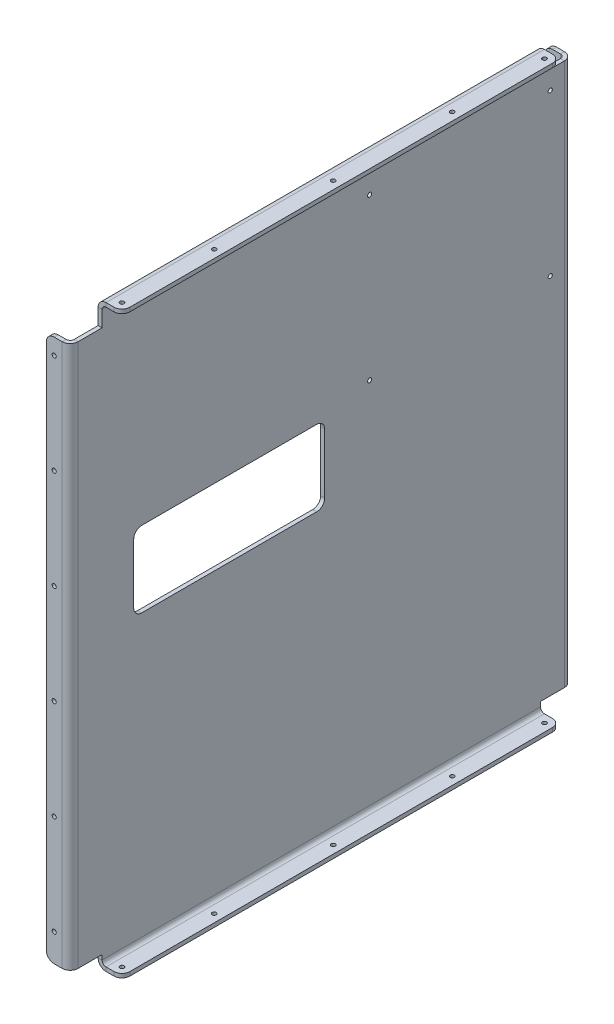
ISO-10303-21;
HEADER;
FILE_DESCRIPTION(('STEP AP214'),'2;1');
FILE_NAME('part.step','',(''),(''),'','','');
FILE_SCHEMA(('AUTOMOTIVE_DESIGN { 1 0 10303 214 1 1 1 1 }'));
ENDSEC;
DATA;
#1=APPLICATION_CONTEXT('core data for automotive mechanical design processes');
#2=APPLICATION_PROTOCOL_DEFINITION('international standard','automotive_design',2000,#1);
#3=PRODUCT_CONTEXT('',#1,'mechanical');
#4=PRODUCT('Part','Part','',(#3));
#5=PRODUCT_RELATED_PRODUCT_CATEGORY('part','',(#4));
#6=PRODUCT_DEFINITION_FORMATION('','',#4);
#7=PRODUCT_DEFINITION_CONTEXT('part definition',#1,'design');
#8=PRODUCT_DEFINITION('design','',#6,#7);
#9=PRODUCT_DEFINITION_SHAPE('','',#8);
#10=(LENGTH_UNIT() NAMED_UNIT(*) SI_UNIT(.MILLI.,.METRE.));
#11=(NAMED_UNIT(*) PLANE_ANGLE_UNIT() SI_UNIT($,.RADIAN.));
#12=(NAMED_UNIT(*) SI_UNIT($,.STERADIAN.) SOLID_ANGLE_UNIT());
#13=UNCERTAINTY_MEASURE_WITH_UNIT(LENGTH_MEASURE(1.E-05),#10,'distance_accuracy_value','');
#14=(GEOMETRIC_REPRESENTATION_CONTEXT(3) GLOBAL_UNCERTAINTY_ASSIGNED_CONTEXT((#13)) GLOBAL_UNIT_ASSIGNED_CONTEXT((#10,
#11,#12)) REPRESENTATION_CONTEXT('',''));
#15=CARTESIAN_POINT('',(0.,0.,0.));
#16=DIRECTION('',(0.,0.,1.));
#17=DIRECTION('',(1.,0.,0.));
#18=AXIS2_PLACEMENT_3D('',#15,#16,#17);
#19=CARTESIAN_POINT('',(0.,0.,0.));
#20=DIRECTION('',(-1.,0.,0.));
#21=DIRECTION('',(0.,0.,1.));
#22=AXIS2_PLACEMENT_3D('',#19,#20,#21);
#23=PLANE('',#22);
#24=DIRECTION('',(0.,0.,1.));
#25=VECTOR('',#24,1.);
#26=CARTESIAN_POINT('',(0.,88.9,0.));
#27=LINE('',#26,#25);
#28=CARTESIAN_POINT('',(0.,88.9,-196.85));
#29=VERTEX_POINT('',#28);
#30=CARTESIAN_POINT('',(0.,88.9,-57.15));
#31=VERTEX_POINT('',#30);
#32=EDGE_CURVE('E737',#29,#31,#27,.T.);
#33=ORIENTED_EDGE('',*,*,#32,.F.);
#34=CARTESIAN_POINT('',(0.,82.55,-196.85));
#35=DIRECTION('',(-1.,0.,0.));
#36=DIRECTION('',(0.,0.,1.));
#37=AXIS2_PLACEMENT_3D('',#34,#35,#36);
#38=CIRCLE('',#37,6.35);
#39=CARTESIAN_POINT('',(0.,82.55,-203.2));
#40=VERTEX_POINT('',#39);
#41=EDGE_CURVE('E788',#29,#40,#38,.T.);
#42=ORIENTED_EDGE('',*,*,#41,.T.);
#43=DIRECTION('',(0.,1.,0.));
#44=VECTOR('',#43,1.);
#45=CARTESIAN_POINT('',(0.,0.,-203.2));
#46=LINE('',#45,#44);
#47=CARTESIAN_POINT('',(0.,34.798,-203.2));
#48=VERTEX_POINT('',#47);
#49=EDGE_CURVE('E718',#48,#40,#46,.T.);
#50=ORIENTED_EDGE('',*,*,#49,.F.);
#51=CARTESIAN_POINT('',(0.,34.798,-196.85));
#52=DIRECTION('',(-1.,0.,0.));
#53=DIRECTION('',(0.,0.,1.));
#54=AXIS2_PLACEMENT_3D('',#51,#52,#53);
#55=CIRCLE('',#54,6.35);
#56=CARTESIAN_POINT('',(0.,28.448,-196.85));
#57=VERTEX_POINT('',#56);
#58=EDGE_CURVE('E784',#48,#57,#55,.T.);
#59=ORIENTED_EDGE('',*,*,#58,.T.);
#60=DIRECTION('',(0.,0.,1.));
#61=VECTOR('',#60,1.);
#62=CARTESIAN_POINT('',(0.,28.448,0.));
#63=LINE('',#62,#61);
#64=CARTESIAN_POINT('',(0.,28.448,-57.15));
#65=VERTEX_POINT('',#64);
#66=EDGE_CURVE('E725',#57,#65,#63,.T.);
#67=ORIENTED_EDGE('',*,*,#66,.T.);
#68=CARTESIAN_POINT('',(0.,34.798,-57.15));
#69=DIRECTION('',(-1.,0.,0.));
#70=DIRECTION('',(0.,0.,1.));
#71=AXIS2_PLACEMENT_3D('',#68,#69,#70);
#72=CIRCLE('',#71,6.35);
#73=CARTESIAN_POINT('',(0.,34.798,-50.8));
#74=VERTEX_POINT('',#73);
#75=EDGE_CURVE('E776',#65,#74,#72,.T.);
#76=ORIENTED_EDGE('',*,*,#75,.T.);
#77=DIRECTION('',(0.,1.,0.));
#78=VECTOR('',#77,1.);
#79=CARTESIAN_POINT('',(0.,0.,-50.8));
#80=LINE('',#79,#78);
#81=CARTESIAN_POINT('',(0.,82.55,-50.8));
#82=VERTEX_POINT('',#81);
#83=EDGE_CURVE('E740',#74,#82,#80,.T.);
#84=ORIENTED_EDGE('',*,*,#83,.T.);
#85=CARTESIAN_POINT('',(0.,82.55,-57.15));
#86=DIRECTION('',(-1.,0.,0.));
#87=DIRECTION('',(0.,0.,1.));
#88=AXIS2_PLACEMENT_3D('',#85,#86,#87);
#89=CIRCLE('',#88,6.35);
#90=EDGE_CURVE('E780',#82,#31,#89,.T.);
#91=ORIENTED_EDGE('',*,*,#90,.T.);
#92=EDGE_LOOP('',(#33,#42,#50,#59,#67,#76,#84,#91));
#93=FACE_BOUND('',#92,.T.);
#94=DIRECTION('',(0.,1.,0.));
#95=VECTOR('',#94,1.);
#96=CARTESIAN_POINT('',(0.,241.3,-6.34999999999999));
#97=LINE('',#96,#95);
#98=CARTESIAN_POINT('',(0.,241.3,-6.34999999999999));
#99=VERTEX_POINT('',#98);
#100=CARTESIAN_POINT('',(0.,-192.000000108,-6.34999999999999));
#101=VERTEX_POINT('',#100);
#102=EDGE_CURVE('E424',#99,#101,#97,.F.);
#103=ORIENTED_EDGE('',*,*,#102,.T.);
#104=DIRECTION('',(0.,0.,-1.));
#105=VECTOR('',#104,1.);
#106=CARTESIAN_POINT('',(0.,-192.000000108,0.));
#107=LINE('',#106,#105);
#108=CARTESIAN_POINT('',(0.,-192.000000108,-25.4999999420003));
#109=VERTEX_POINT('',#108);
#110=EDGE_CURVE('E752',#101,#109,#107,.T.);
#111=ORIENTED_EDGE('',*,*,#110,.T.);
#112=DIRECTION('',(0.,1.,0.));
#113=VECTOR('',#112,1.);
#114=CARTESIAN_POINT('',(0.,-195.770000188,-25.4999999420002));
#115=LINE('',#114,#113);
#116=CARTESIAN_POINT('',(0.,-195.770000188,-25.4999999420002));
#117=VERTEX_POINT('',#116);
#118=EDGE_CURVE('E710',#117,#109,#115,.T.);
#119=ORIENTED_EDGE('',*,*,#118,.F.);
#120=DIRECTION('',(0.,0.,-1.));
#121=VECTOR('',#120,1.);
#122=CARTESIAN_POINT('',(-1.01481323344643E-13,-195.770000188,-375.499999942));
#123=LINE('',#122,#121);
#124=CARTESIAN_POINT('',(-1.01481323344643E-13,-195.770000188,-375.499999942));
#125=VERTEX_POINT('',#124);
#126=EDGE_CURVE('E695',#125,#117,#123,.F.);
#127=ORIENTED_EDGE('',*,*,#126,.F.);
#128=DIRECTION('',(0.,1.,0.));
#129=VECTOR('',#128,1.);
#130=CARTESIAN_POINT('',(-1.01481323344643E-13,-195.770000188,-375.499999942));
#131=LINE('',#130,#129);
#132=CARTESIAN_POINT('',(-1.01481323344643E-13,-192.000000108,-375.499999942));
#133=VERTEX_POINT('',#132);
#134=EDGE_CURVE('E716',#125,#133,#131,.T.);
#135=ORIENTED_EDGE('',*,*,#134,.T.);
#136=CARTESIAN_POINT('',(0.,-192.000000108,-394.649999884));
#137=VERTEX_POINT('',#136);
#138=EDGE_CURVE('E734',#133,#137,#107,.T.);
#139=ORIENTED_EDGE('',*,*,#138,.T.);
#140=DIRECTION('',(0.,-1.,0.));
#141=VECTOR('',#140,1.);
#142=CARTESIAN_POINT('',(0.,-192.000000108,-394.649999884));
#143=LINE('',#142,#141);
#144=CARTESIAN_POINT('',(0.,241.3,-394.649999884));
#145=VERTEX_POINT('',#144);
#146=EDGE_CURVE('E506',#137,#145,#143,.F.);
#147=ORIENTED_EDGE('',*,*,#146,.T.);
#148=DIRECTION('',(0.,0.,1.));
#149=VECTOR('',#148,1.);
#150=CARTESIAN_POINT('',(0.,241.3,0.));
#151=LINE('',#150,#149);
#152=CARTESIAN_POINT('',(0.,241.3,-375.499999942));
#153=VERTEX_POINT('',#152);
#154=EDGE_CURVE('E755',#145,#153,#151,.T.);
#155=ORIENTED_EDGE('',*,*,#154,.T.);
#156=DIRECTION('',(0.,-1.,0.));
#157=VECTOR('',#156,1.);
#158=CARTESIAN_POINT('',(0.,254.,-375.499999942));
#159=LINE('',#158,#157);
#160=CARTESIAN_POINT('',(0.,254.,-375.499999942));
#161=VERTEX_POINT('',#160);
#162=EDGE_CURVE('E613',#161,#153,#159,.T.);
#163=ORIENTED_EDGE('',*,*,#162,.F.);
#164=DIRECTION('',(0.,0.,1.));
#165=VECTOR('',#164,1.);
#166=CARTESIAN_POINT('',(0.,254.,-25.499999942));
#167=LINE('',#166,#165);
#168=CARTESIAN_POINT('',(0.,254.,-25.499999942));
#169=VERTEX_POINT('',#168);
#170=EDGE_CURVE('E598',#169,#161,#167,.F.);
#171=ORIENTED_EDGE('',*,*,#170,.F.);
#172=DIRECTION('',(0.,-1.,0.));
#173=VECTOR('',#172,1.);
#174=CARTESIAN_POINT('',(0.,254.,-25.499999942));
#175=LINE('',#174,#173);
#176=CARTESIAN_POINT('',(0.,241.3,-25.499999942));
#177=VERTEX_POINT('',#176);
#178=EDGE_CURVE('E619',#169,#177,#175,.T.);
#179=ORIENTED_EDGE('',*,*,#178,.T.);
#180=EDGE_CURVE('E754',#177,#99,#151,.T.);
#181=ORIENTED_EDGE('',*,*,#180,.T.);
#182=EDGE_LOOP('',(#103,#111,#119,#127,#135,#139,#147,#155,#163,#171,#179,#181));
#183=FACE_BOUND('',#182,.T.);
#184=CARTESIAN_POINT('',(0.,226.459999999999,-383.284999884));
#185=DIRECTION('',(1.,0.,0.));
#186=DIRECTION('',(0.,0.,-1.));
#187=AXIS2_PLACEMENT_3D('',#184,#185,#186);
#188=CIRCLE('',#187,1.65000000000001);
#189=CARTESIAN_POINT('',(0.,226.459999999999,-384.934999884));
#190=VERTEX_POINT('',#189);
#191=EDGE_CURVE('E2154',#190,#190,#188,.T.);
#192=ORIENTED_EDGE('',*,*,#191,.F.);
#193=EDGE_LOOP('',(#192));
#194=FACE_BOUND('',#193,.T.);
#195=CARTESIAN_POINT('',(0.,98.1899999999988,-239.139999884));
#196=DIRECTION('',(1.,0.,0.));
#197=DIRECTION('',(0.,0.,-1.));
#198=AXIS2_PLACEMENT_3D('',#195,#196,#197);
#199=CIRCLE('',#198,1.65);
#200=CARTESIAN_POINT('',(0.,98.1899999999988,-240.789999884));
#201=VERTEX_POINT('',#200);
#202=EDGE_CURVE('E2255',#201,#201,#199,.T.);
#203=ORIENTED_EDGE('',*,*,#202,.F.);
#204=EDGE_LOOP('',(#203));
#205=FACE_BOUND('',#204,.T.);
#206=CARTESIAN_POINT('',(0.,98.1899999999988,-383.284999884));
#207=DIRECTION('',(1.,0.,0.));
#208=DIRECTION('',(0.,0.,-1.));
#209=AXIS2_PLACEMENT_3D('',#206,#207,#208);
#210=CIRCLE('',#209,1.65);
#211=CARTESIAN_POINT('',(0.,98.1899999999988,-384.934999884));
#212=VERTEX_POINT('',#211);
#213=EDGE_CURVE('E2259',#212,#212,#210,.T.);
#214=ORIENTED_EDGE('',*,*,#213,.F.);
#215=EDGE_LOOP('',(#214));
#216=FACE_BOUND('',#215,.T.);
#217=CARTESIAN_POINT('',(0.,226.459999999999,-239.139999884));
#218=DIRECTION('',(1.,0.,0.));
#219=DIRECTION('',(0.,0.,-1.));
#220=AXIS2_PLACEMENT_3D('',#217,#218,#219);
#221=CIRCLE('',#220,1.65000000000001);
#222=CARTESIAN_POINT('',(0.,226.459999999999,-240.789999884));
#223=VERTEX_POINT('',#222);
#224=EDGE_CURVE('E2263',#223,#223,#221,.T.);
#225=ORIENTED_EDGE('',*,*,#224,.F.);
#226=EDGE_LOOP('',(#225));
#227=FACE_BOUND('',#226,.T.);
#228=ADVANCED_FACE('F132',(#93,#183,#194,#205,#216,#227),#23,.F.);
#229=CARTESIAN_POINT('',(1.41328839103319E-12,0.,-400.999999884));
#230=DIRECTION('',(0.,0.,1.));
#231=DIRECTION('',(1.,0.,0.));
#232=AXIS2_PLACEMENT_3D('',#229,#230,#231);
#233=PLANE('',#232);
#234=DIRECTION('',(0.,1.,0.));
#235=VECTOR('',#234,1.);
#236=CARTESIAN_POINT('',(-19.05,0.,-400.999999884));
#237=LINE('',#236,#235);
#238=CARTESIAN_POINT('',(-19.05,-185.650000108,-400.999999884));
#239=VERTEX_POINT('',#238);
#240=CARTESIAN_POINT('',(-19.05,234.95,-400.999999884));
#241=VERTEX_POINT('',#240);
#242=EDGE_CURVE('E482',#239,#241,#237,.T.);
#243=ORIENTED_EDGE('',*,*,#242,.T.);
#244=CARTESIAN_POINT('',(-12.7,234.95,-400.999999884));
#245=DIRECTION('',(0.,0.,1.));
#246=DIRECTION('',(1.,0.,0.));
#247=AXIS2_PLACEMENT_3D('',#244,#245,#246);
#248=CIRCLE('',#247,6.35);
#249=CARTESIAN_POINT('',(-12.7,241.3,-400.999999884));
#250=VERTEX_POINT('',#249);
#251=EDGE_CURVE('E842',#241,#250,#248,.F.);
#252=ORIENTED_EDGE('',*,*,#251,.T.);
#253=DIRECTION('',(1.,0.,0.));
#254=VECTOR('',#253,1.);
#255=CARTESIAN_POINT('',(1.41328839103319E-12,241.3,-400.999999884));
#256=LINE('',#255,#254);
#257=CARTESIAN_POINT('',(-6.34999999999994,241.3,-400.999999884));
#258=VERTEX_POINT('',#257);
#259=EDGE_CURVE('E479',#250,#258,#256,.T.);
#260=ORIENTED_EDGE('',*,*,#259,.T.);
#261=DIRECTION('',(0.,-1.,0.));
#262=VECTOR('',#261,1.);
#263=CARTESIAN_POINT('',(-6.34999999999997,241.3,-400.999999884));
#264=LINE('',#263,#262);
#265=CARTESIAN_POINT('',(-6.34999999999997,-192.000000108,-400.999999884));
#266=VERTEX_POINT('',#265);
#267=EDGE_CURVE('E496',#266,#258,#264,.F.);
#268=ORIENTED_EDGE('',*,*,#267,.F.);
#269=DIRECTION('',(-1.,0.,0.));
#270=VECTOR('',#269,1.);
#271=CARTESIAN_POINT('',(1.41328839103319E-12,-192.000000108,-400.999999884));
#272=LINE('',#271,#270);
#273=CARTESIAN_POINT('',(-12.7,-192.000000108,-400.999999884));
#274=VERTEX_POINT('',#273);
#275=EDGE_CURVE('E485',#266,#274,#272,.T.);
#276=ORIENTED_EDGE('',*,*,#275,.T.);
#277=CARTESIAN_POINT('',(-12.7,-185.650000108,-400.999999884));
#278=DIRECTION('',(0.,0.,1.));
#279=DIRECTION('',(1.,0.,0.));
#280=AXIS2_PLACEMENT_3D('',#277,#278,#279);
#281=CIRCLE('',#280,6.35);
#282=EDGE_CURVE('E840',#274,#239,#281,.F.);
#283=ORIENTED_EDGE('',*,*,#282,.T.);
#284=EDGE_LOOP('',(#243,#252,#260,#268,#276,#283));
#285=FACE_BOUND('',#284,.T.);
#286=CARTESIAN_POINT('',(-12.7,-169.771666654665,-400.999999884));
#287=DIRECTION('',(0.,0.,-1.));
#288=DIRECTION('',(-1.,0.,0.));
#289=AXIS2_PLACEMENT_3D('',#286,#287,#288);
#290=CIRCLE('',#289,1.64999999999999);
#291=CARTESIAN_POINT('',(-14.3499999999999,-169.771666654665,-400.999999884));
#292=VERTEX_POINT('',#291);
#293=EDGE_CURVE('E2130',#292,#292,#290,.T.);
#294=ORIENTED_EDGE('',*,*,#293,.F.);
#295=EDGE_LOOP('',(#294));
#296=FACE_BOUND('',#295,.T.);
#297=CARTESIAN_POINT('',(-12.7,-90.0973333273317,-400.999999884));
#298=DIRECTION('',(0.,0.,-1.));
#299=DIRECTION('',(-1.,0.,0.));
#300=AXIS2_PLACEMENT_3D('',#297,#298,#299);
#301=CIRCLE('',#300,1.64999999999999);
#302=CARTESIAN_POINT('',(-14.35,-90.0973333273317,-400.999999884));
#303=VERTEX_POINT('',#302);
#304=EDGE_CURVE('E2134',#303,#303,#301,.T.);
#305=ORIENTED_EDGE('',*,*,#304,.F.);
#306=EDGE_LOOP('',(#305));
#307=FACE_BOUND('',#306,.T.);
#308=CARTESIAN_POINT('',(-12.7,-10.4229999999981,-400.999999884));
#309=DIRECTION('',(0.,0.,-1.));
#310=DIRECTION('',(-1.,0.,0.));
#311=AXIS2_PLACEMENT_3D('',#308,#309,#310);
#312=CIRCLE('',#311,1.64999999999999);
#313=CARTESIAN_POINT('',(-14.35,-10.4229999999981,-400.999999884));
#314=VERTEX_POINT('',#313);
#315=EDGE_CURVE('E2138',#314,#314,#312,.T.);
#316=ORIENTED_EDGE('',*,*,#315,.F.);
#317=EDGE_LOOP('',(#316));
#318=FACE_BOUND('',#317,.T.);
#319=CARTESIAN_POINT('',(-12.7,69.2513333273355,-400.999999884));
#320=DIRECTION('',(0.,0.,-1.));
#321=DIRECTION('',(-1.,0.,0.));
#322=AXIS2_PLACEMENT_3D('',#319,#320,#321);
#323=CIRCLE('',#322,1.64999999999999);
#324=CARTESIAN_POINT('',(-14.35,69.2513333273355,-400.999999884));
#325=VERTEX_POINT('',#324);
#326=EDGE_CURVE('E2142',#325,#325,#323,.T.);
#327=ORIENTED_EDGE('',*,*,#326,.F.);
#328=EDGE_LOOP('',(#327));
#329=FACE_BOUND('',#328,.T.);
#330=CARTESIAN_POINT('',(-12.7,148.925666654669,-400.999999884));
#331=DIRECTION('',(0.,0.,-1.));
#332=DIRECTION('',(-1.,0.,0.));
#333=AXIS2_PLACEMENT_3D('',#330,#331,#332);
#334=CIRCLE('',#333,1.64999999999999);
#335=CARTESIAN_POINT('',(-14.35,148.925666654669,-400.999999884));
#336=VERTEX_POINT('',#335);
#337=EDGE_CURVE('E2146',#336,#336,#334,.T.);
#338=ORIENTED_EDGE('',*,*,#337,.F.);
#339=EDGE_LOOP('',(#338));
#340=FACE_BOUND('',#339,.T.);
#341=CARTESIAN_POINT('',(-12.7,228.599999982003,-400.999999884));
#342=DIRECTION('',(0.,0.,-1.));
#343=DIRECTION('',(-1.,0.,0.));
#344=AXIS2_PLACEMENT_3D('',#341,#342,#343);
#345=CIRCLE('',#344,1.64999999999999);
#346=CARTESIAN_POINT('',(-14.35,228.599999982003,-400.999999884));
#347=VERTEX_POINT('',#346);
#348=EDGE_CURVE('E2149',#347,#347,#345,.T.);
#349=ORIENTED_EDGE('',*,*,#348,.F.);
#350=EDGE_LOOP('',(#349));
#351=FACE_BOUND('',#350,.T.);
#352=ADVANCED_FACE('F958',(#285,#296,#307,#318,#329,#340,#351),#233,.F.);
#353=CARTESIAN_POINT('',(0.,0.,0.));
#354=DIRECTION('',(0.,0.,-1.));
#355=DIRECTION('',(-1.,0.,0.));
#356=AXIS2_PLACEMENT_3D('',#353,#354,#355);
#357=PLANE('',#356);
#358=CARTESIAN_POINT('',(-12.7,-169.771666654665,0.));
#359=DIRECTION('',(0.,0.,1.));
#360=DIRECTION('',(1.,0.,0.));
#361=AXIS2_PLACEMENT_3D('',#358,#359,#360);
#362=CIRCLE('',#361,1.64999999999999);
#363=CARTESIAN_POINT('',(-11.05,-169.771666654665,0.));
#364=VERTEX_POINT('',#363);
#365=EDGE_CURVE('E2208',#364,#364,#362,.T.);
#366=ORIENTED_EDGE('',*,*,#365,.F.);
#367=EDGE_LOOP('',(#366));
#368=FACE_BOUND('',#367,.T.);
#369=DIRECTION('',(0.,-1.,0.));
#370=VECTOR('',#369,1.);
#371=CARTESIAN_POINT('',(-19.05,0.,0.));
#372=LINE('',#371,#370);
#373=CARTESIAN_POINT('',(-19.05,234.95,0.));
#374=VERTEX_POINT('',#373);
#375=CARTESIAN_POINT('',(-19.05,-185.650000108,0.));
#376=VERTEX_POINT('',#375);
#377=EDGE_CURVE('E448',#374,#376,#372,.T.);
#378=ORIENTED_EDGE('',*,*,#377,.T.);
#379=CARTESIAN_POINT('',(-12.7,-185.650000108,0.));
#380=DIRECTION('',(0.,0.,-1.));
#381=DIRECTION('',(-1.,0.,0.));
#382=AXIS2_PLACEMENT_3D('',#379,#380,#381);
#383=CIRCLE('',#382,6.35);
#384=CARTESIAN_POINT('',(-12.7,-192.000000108,0.));
#385=VERTEX_POINT('',#384);
#386=EDGE_CURVE('E140',#376,#385,#383,.F.);
#387=ORIENTED_EDGE('',*,*,#386,.T.);
#388=DIRECTION('',(1.,0.,0.));
#389=VECTOR('',#388,1.);
#390=CARTESIAN_POINT('',(0.,-192.000000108,0.));
#391=LINE('',#390,#389);
#392=CARTESIAN_POINT('',(-6.34999999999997,-192.000000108,0.));
#393=VERTEX_POINT('',#392);
#394=EDGE_CURVE('E444',#385,#393,#391,.T.);
#395=ORIENTED_EDGE('',*,*,#394,.T.);
#396=DIRECTION('',(0.,1.,0.));
#397=VECTOR('',#396,1.);
#398=CARTESIAN_POINT('',(-6.34999999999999,-192.000000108,0.));
#399=LINE('',#398,#397);
#400=CARTESIAN_POINT('',(-6.34999999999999,241.3,0.));
#401=VERTEX_POINT('',#400);
#402=EDGE_CURVE('E421',#401,#393,#399,.F.);
#403=ORIENTED_EDGE('',*,*,#402,.F.);
#404=DIRECTION('',(-1.,0.,0.));
#405=VECTOR('',#404,1.);
#406=CARTESIAN_POINT('',(0.,241.3,0.));
#407=LINE('',#406,#405);
#408=CARTESIAN_POINT('',(-12.7,241.3,0.));
#409=VERTEX_POINT('',#408);
#410=EDGE_CURVE('E441',#401,#409,#407,.T.);
#411=ORIENTED_EDGE('',*,*,#410,.T.);
#412=CARTESIAN_POINT('',(-12.7,234.95,0.));
#413=DIRECTION('',(0.,0.,-1.));
#414=DIRECTION('',(-1.,0.,0.));
#415=AXIS2_PLACEMENT_3D('',#412,#413,#414);
#416=CIRCLE('',#415,6.35);
#417=EDGE_CURVE('E857',#409,#374,#416,.F.);
#418=ORIENTED_EDGE('',*,*,#417,.T.);
#419=EDGE_LOOP('',(#378,#387,#395,#403,#411,#418));
#420=FACE_BOUND('',#419,.T.);
#421=CARTESIAN_POINT('',(-12.7,-90.0973333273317,0.));
#422=DIRECTION('',(0.,0.,1.));
#423=DIRECTION('',(1.,0.,0.));
#424=AXIS2_PLACEMENT_3D('',#421,#422,#423);
#425=CIRCLE('',#424,1.64999999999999);
#426=CARTESIAN_POINT('',(-11.05,-90.0973333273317,0.));
#427=VERTEX_POINT('',#426);
#428=EDGE_CURVE('E2202',#427,#427,#425,.T.);
#429=ORIENTED_EDGE('',*,*,#428,.F.);
#430=EDGE_LOOP('',(#429));
#431=FACE_BOUND('',#430,.T.);
#432=CARTESIAN_POINT('',(-12.7,-10.4229999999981,0.));
#433=DIRECTION('',(0.,0.,1.));
#434=DIRECTION('',(1.,0.,0.));
#435=AXIS2_PLACEMENT_3D('',#432,#433,#434);
#436=CIRCLE('',#435,1.64999999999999);
#437=CARTESIAN_POINT('',(-11.05,-10.4229999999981,0.));
#438=VERTEX_POINT('',#437);
#439=EDGE_CURVE('E2196',#438,#438,#436,.T.);
#440=ORIENTED_EDGE('',*,*,#439,.F.);
#441=EDGE_LOOP('',(#440));
#442=FACE_BOUND('',#441,.T.);
#443=CARTESIAN_POINT('',(-12.7,69.2513333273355,0.));
#444=DIRECTION('',(0.,0.,1.));
#445=DIRECTION('',(1.,0.,0.));
#446=AXIS2_PLACEMENT_3D('',#443,#444,#445);
#447=CIRCLE('',#446,1.64999999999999);
#448=CARTESIAN_POINT('',(-11.05,69.2513333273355,0.));
#449=VERTEX_POINT('',#448);
#450=EDGE_CURVE('E2190',#449,#449,#447,.T.);
#451=ORIENTED_EDGE('',*,*,#450,.F.);
#452=EDGE_LOOP('',(#451));
#453=FACE_BOUND('',#452,.T.);
#454=CARTESIAN_POINT('',(-12.7,148.925666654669,0.));
#455=DIRECTION('',(0.,0.,1.));
#456=DIRECTION('',(1.,0.,0.));
#457=AXIS2_PLACEMENT_3D('',#454,#455,#456);
#458=CIRCLE('',#457,1.64999999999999);
#459=CARTESIAN_POINT('',(-11.05,148.925666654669,0.));
#460=VERTEX_POINT('',#459);
#461=EDGE_CURVE('E2184',#460,#460,#458,.T.);
#462=ORIENTED_EDGE('',*,*,#461,.F.);
#463=EDGE_LOOP('',(#462));
#464=FACE_BOUND('',#463,.T.);
#465=CARTESIAN_POINT('',(-12.7,228.599999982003,0.));
#466=DIRECTION('',(0.,0.,1.));
#467=DIRECTION('',(1.,0.,0.));
#468=AXIS2_PLACEMENT_3D('',#465,#466,#467);
#469=CIRCLE('',#468,1.64999999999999);
#470=CARTESIAN_POINT('',(-11.05,228.599999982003,0.));
#471=VERTEX_POINT('',#470);
#472=EDGE_CURVE('E2178',#471,#471,#469,.T.);
#473=ORIENTED_EDGE('',*,*,#472,.F.);
#474=EDGE_LOOP('',(#473));
#475=FACE_BOUND('',#474,.T.);
#476=ADVANCED_FACE('F439',(#368,#420,#431,#442,#453,#464,#475),#357,.F.);
#477=CARTESIAN_POINT('',(-3.175,0.,0.));
#478=DIRECTION('',(-1.,0.,0.));
#479=DIRECTION('',(0.,0.,1.));
#480=AXIS2_PLACEMENT_3D('',#477,#478,#479);
#481=PLANE('',#480);
#482=CARTESIAN_POINT('',(-3.175,226.459999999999,-239.139999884));
#483=DIRECTION('',(-1.,0.,0.));
#484=DIRECTION('',(0.,0.,1.));
#485=AXIS2_PLACEMENT_3D('',#482,#483,#484);
#486=CIRCLE('',#485,1.65000000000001);
#487=CARTESIAN_POINT('',(-3.175,226.459999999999,-237.489999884));
#488=VERTEX_POINT('',#487);
#489=EDGE_CURVE('E1811',#488,#488,#486,.T.);
#490=ORIENTED_EDGE('',*,*,#489,.F.);
#491=EDGE_LOOP('',(#490));
#492=FACE_BOUND('',#491,.T.);
#493=CARTESIAN_POINT('',(-3.175,98.1899999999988,-383.284999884));
#494=DIRECTION('',(-1.,0.,0.));
#495=DIRECTION('',(0.,0.,1.));
#496=AXIS2_PLACEMENT_3D('',#493,#494,#495);
#497=CIRCLE('',#496,1.65);
#498=CARTESIAN_POINT('',(-3.175,98.1899999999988,-381.634999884));
#499=VERTEX_POINT('',#498);
#500=EDGE_CURVE('E1815',#499,#499,#497,.T.);
#501=ORIENTED_EDGE('',*,*,#500,.F.);
#502=EDGE_LOOP('',(#501));
#503=FACE_BOUND('',#502,.T.);
#504=CARTESIAN_POINT('',(-3.175,98.1899999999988,-239.139999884));
#505=DIRECTION('',(-1.,0.,0.));
#506=DIRECTION('',(0.,0.,1.));
#507=AXIS2_PLACEMENT_3D('',#504,#505,#506);
#508=CIRCLE('',#507,1.65);
#509=CARTESIAN_POINT('',(-3.175,98.1899999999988,-237.489999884));
#510=VERTEX_POINT('',#509);
#511=EDGE_CURVE('E1819',#510,#510,#508,.T.);
#512=ORIENTED_EDGE('',*,*,#511,.F.);
#513=EDGE_LOOP('',(#512));
#514=FACE_BOUND('',#513,.T.);
#515=CARTESIAN_POINT('',(-3.175,226.459999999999,-383.284999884));
#516=DIRECTION('',(-1.,0.,0.));
#517=DIRECTION('',(0.,0.,1.));
#518=AXIS2_PLACEMENT_3D('',#515,#516,#517);
#519=CIRCLE('',#518,1.65000000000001);
#520=CARTESIAN_POINT('',(-3.175,226.459999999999,-381.634999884));
#521=VERTEX_POINT('',#520);
#522=EDGE_CURVE('E1823',#521,#521,#519,.T.);
#523=ORIENTED_EDGE('',*,*,#522,.F.);
#524=EDGE_LOOP('',(#523));
#525=FACE_BOUND('',#524,.T.);
#526=DIRECTION('',(0.,0.,1.));
#527=VECTOR('',#526,1.);
#528=CARTESIAN_POINT('',(-3.175,28.448,0.));
#529=LINE('',#528,#527);
#530=CARTESIAN_POINT('',(-3.175,28.448,-196.85));
#531=VERTEX_POINT('',#530);
#532=CARTESIAN_POINT('',(-3.175,28.448,-57.15));
#533=VERTEX_POINT('',#532);
#534=EDGE_CURVE('E731',#531,#533,#529,.T.);
#535=ORIENTED_EDGE('',*,*,#534,.F.);
#536=CARTESIAN_POINT('',(-3.175,34.798,-196.85));
#537=DIRECTION('',(-1.,0.,0.));
#538=DIRECTION('',(0.,0.,1.));
#539=AXIS2_PLACEMENT_3D('',#536,#537,#538);
#540=CIRCLE('',#539,6.35);
#541=CARTESIAN_POINT('',(-3.175,34.798,-203.2));
#542=VERTEX_POINT('',#541);
#543=EDGE_CURVE('E786',#531,#542,#540,.F.);
#544=ORIENTED_EDGE('',*,*,#543,.T.);
#545=DIRECTION('',(0.,1.,0.));
#546=VECTOR('',#545,1.);
#547=CARTESIAN_POINT('',(-3.175,0.,-203.2));
#548=LINE('',#547,#546);
#549=CARTESIAN_POINT('',(-3.175,82.55,-203.2));
#550=VERTEX_POINT('',#549);
#551=EDGE_CURVE('E721',#542,#550,#548,.T.);
#552=ORIENTED_EDGE('',*,*,#551,.T.);
#553=CARTESIAN_POINT('',(-3.175,82.55,-196.85));
#554=DIRECTION('',(-1.,0.,0.));
#555=DIRECTION('',(0.,0.,1.));
#556=AXIS2_PLACEMENT_3D('',#553,#554,#555);
#557=CIRCLE('',#556,6.35);
#558=CARTESIAN_POINT('',(-3.175,88.9,-196.85));
#559=VERTEX_POINT('',#558);
#560=EDGE_CURVE('E790',#550,#559,#557,.F.);
#561=ORIENTED_EDGE('',*,*,#560,.T.);
#562=DIRECTION('',(0.,0.,1.));
#563=VECTOR('',#562,1.);
#564=CARTESIAN_POINT('',(-3.175,88.9,0.));
#565=LINE('',#564,#563);
#566=CARTESIAN_POINT('',(-3.175,88.9,-57.15));
#567=VERTEX_POINT('',#566);
#568=EDGE_CURVE('E724',#559,#567,#565,.T.);
#569=ORIENTED_EDGE('',*,*,#568,.T.);
#570=CARTESIAN_POINT('',(-3.175,82.55,-57.15));
#571=DIRECTION('',(-1.,0.,0.));
#572=DIRECTION('',(0.,0.,1.));
#573=AXIS2_PLACEMENT_3D('',#570,#571,#572);
#574=CIRCLE('',#573,6.35);
#575=CARTESIAN_POINT('',(-3.175,82.55,-50.8));
#576=VERTEX_POINT('',#575);
#577=EDGE_CURVE('E782',#567,#576,#574,.F.);
#578=ORIENTED_EDGE('',*,*,#577,.T.);
#579=DIRECTION('',(0.,1.,0.));
#580=VECTOR('',#579,1.);
#581=CARTESIAN_POINT('',(-3.175,0.,-50.8));
#582=LINE('',#581,#580);
#583=CARTESIAN_POINT('',(-3.175,34.798,-50.8));
#584=VERTEX_POINT('',#583);
#585=EDGE_CURVE('E728',#584,#576,#582,.T.);
#586=ORIENTED_EDGE('',*,*,#585,.F.);
#587=CARTESIAN_POINT('',(-3.175,34.798,-57.15));
#588=DIRECTION('',(-1.,0.,0.));
#589=DIRECTION('',(0.,0.,1.));
#590=AXIS2_PLACEMENT_3D('',#587,#588,#589);
#591=CIRCLE('',#590,6.35);
#592=EDGE_CURVE('E778',#584,#533,#591,.F.);
#593=ORIENTED_EDGE('',*,*,#592,.T.);
#594=EDGE_LOOP('',(#535,#544,#552,#561,#569,#578,#586,#593));
#595=FACE_BOUND('',#594,.T.);
#596=DIRECTION('',(0.,0.,-1.));
#597=VECTOR('',#596,1.);
#598=CARTESIAN_POINT('',(-3.175,-192.000000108,0.));
#599=LINE('',#598,#597);
#600=CARTESIAN_POINT('',(-3.175,-192.000000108,-6.34999999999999));
#601=VERTEX_POINT('',#600);
#602=CARTESIAN_POINT('',(-3.17499999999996,-192.000000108,-25.4999999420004));
#603=VERTEX_POINT('',#602);
#604=EDGE_CURVE('E745',#601,#603,#599,.T.);
#605=ORIENTED_EDGE('',*,*,#604,.F.);
#606=DIRECTION('',(0.,1.,0.));
#607=VECTOR('',#606,1.);
#608=CARTESIAN_POINT('',(-3.17499999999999,241.3,-6.34999999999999));
#609=LINE('',#608,#607);
#610=CARTESIAN_POINT('',(-3.175,241.3,-6.34999999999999));
#611=VERTEX_POINT('',#610);
#612=EDGE_CURVE('E469',#611,#601,#609,.F.);
#613=ORIENTED_EDGE('',*,*,#612,.F.);
#614=DIRECTION('',(0.,0.,1.));
#615=VECTOR('',#614,1.);
#616=CARTESIAN_POINT('',(-3.175,241.3,0.));
#617=LINE('',#616,#615);
#618=CARTESIAN_POINT('',(-3.175,241.3,-25.499999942));
#619=VERTEX_POINT('',#618);
#620=EDGE_CURVE('E747',#619,#611,#617,.T.);
#621=ORIENTED_EDGE('',*,*,#620,.F.);
#622=DIRECTION('',(0.,-1.,0.));
#623=VECTOR('',#622,1.);
#624=CARTESIAN_POINT('',(-3.17499999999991,254.,-25.499999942));
#625=LINE('',#624,#623);
#626=CARTESIAN_POINT('',(-3.17499999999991,254.,-25.499999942));
#627=VERTEX_POINT('',#626);
#628=EDGE_CURVE('E617',#627,#619,#625,.T.);
#629=ORIENTED_EDGE('',*,*,#628,.F.);
#630=DIRECTION('',(0.,0.,1.));
#631=VECTOR('',#630,1.);
#632=CARTESIAN_POINT('',(-3.17499999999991,254.,-25.499999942));
#633=LINE('',#632,#631);
#634=CARTESIAN_POINT('',(-3.17499999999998,254.,-375.499999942));
#635=VERTEX_POINT('',#634);
#636=EDGE_CURVE('E585',#627,#635,#633,.F.);
#637=ORIENTED_EDGE('',*,*,#636,.T.);
#638=DIRECTION('',(0.,-1.,0.));
#639=VECTOR('',#638,1.);
#640=CARTESIAN_POINT('',(-3.17499999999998,254.,-375.499999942));
#641=LINE('',#640,#639);
#642=CARTESIAN_POINT('',(-3.17499999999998,241.3,-375.499999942));
#643=VERTEX_POINT('',#642);
#644=EDGE_CURVE('E614',#635,#643,#641,.T.);
#645=ORIENTED_EDGE('',*,*,#644,.T.);
#646=CARTESIAN_POINT('',(-3.175,241.3,-394.649999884));
#647=VERTEX_POINT('',#646);
#648=EDGE_CURVE('E749',#647,#643,#617,.T.);
#649=ORIENTED_EDGE('',*,*,#648,.F.);
#650=DIRECTION('',(0.,-1.,0.));
#651=VECTOR('',#650,1.);
#652=CARTESIAN_POINT('',(-3.17499999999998,-192.000000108,-394.649999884));
#653=LINE('',#652,#651);
#654=CARTESIAN_POINT('',(-3.175,-192.000000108,-394.649999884));
#655=VERTEX_POINT('',#654);
#656=EDGE_CURVE('E518',#655,#647,#653,.F.);
#657=ORIENTED_EDGE('',*,*,#656,.F.);
#658=CARTESIAN_POINT('',(-3.175,-192.000000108,-375.499999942));
#659=VERTEX_POINT('',#658);
#660=EDGE_CURVE('E748',#659,#655,#599,.T.);
#661=ORIENTED_EDGE('',*,*,#660,.F.);
#662=DIRECTION('',(0.,1.,0.));
#663=VECTOR('',#662,1.);
#664=CARTESIAN_POINT('',(-3.1750000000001,-195.770000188,-375.499999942));
#665=LINE('',#664,#663);
#666=CARTESIAN_POINT('',(-3.1750000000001,-195.770000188,-375.499999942));
#667=VERTEX_POINT('',#666);
#668=EDGE_CURVE('E714',#667,#659,#665,.T.);
#669=ORIENTED_EDGE('',*,*,#668,.F.);
#670=DIRECTION('',(0.,0.,-1.));
#671=VECTOR('',#670,1.);
#672=CARTESIAN_POINT('',(-3.1750000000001,-195.770000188,-375.499999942));
#673=LINE('',#672,#671);
#674=CARTESIAN_POINT('',(-3.17499999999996,-195.770000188,-25.4999999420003));
#675=VERTEX_POINT('',#674);
#676=EDGE_CURVE('E682',#667,#675,#673,.F.);
#677=ORIENTED_EDGE('',*,*,#676,.T.);
#678=DIRECTION('',(0.,1.,0.));
#679=VECTOR('',#678,1.);
#680=CARTESIAN_POINT('',(-3.17499999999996,-195.770000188,-25.4999999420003));
#681=LINE('',#680,#679);
#682=EDGE_CURVE('E711',#675,#603,#681,.T.);
#683=ORIENTED_EDGE('',*,*,#682,.T.);
#684=EDGE_LOOP('',(#605,#613,#621,#629,#637,#645,#649,#657,#661,#669,#677,#683));
#685=FACE_BOUND('',#684,.T.);
#686=ADVANCED_FACE('F883',(#492,#503,#514,#525,#595,#685),#481,.T.);
#687=CARTESIAN_POINT('',(-3.175,241.3,0.));
#688=DIRECTION('',(0.,1.,0.));
#689=DIRECTION('',(0.,0.,1.));
#690=AXIS2_PLACEMENT_3D('',#687,#688,#689);
#691=PLANE('',#690);
#692=ORIENTED_EDGE('',*,*,#620,.T.);
#693=DIRECTION('',(1.,0.,0.));
#694=VECTOR('',#693,1.);
#695=CARTESIAN_POINT('',(-3.17499999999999,241.3,-6.34999999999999));
#696=LINE('',#695,#694);
#697=EDGE_CURVE('E465',#611,#99,#696,.T.);
#698=ORIENTED_EDGE('',*,*,#697,.T.);
#699=ORIENTED_EDGE('',*,*,#180,.F.);
#700=DIRECTION('',(-1.,0.,0.));
#701=VECTOR('',#700,1.);
#702=CARTESIAN_POINT('',(0.,241.3,-25.499999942));
#703=LINE('',#702,#701);
#704=EDGE_CURVE('E610',#177,#619,#703,.T.);
#705=ORIENTED_EDGE('',*,*,#704,.T.);
#706=EDGE_LOOP('',(#692,#698,#699,#705));
#707=FACE_BOUND('',#706,.T.);
#708=ADVANCED_FACE('F900',(#707),#691,.T.);
#709=CARTESIAN_POINT('',(-3.175,-192.000000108,0.));
#710=DIRECTION('',(0.,-1.,0.));
#711=DIRECTION('',(0.,0.,-1.));
#712=AXIS2_PLACEMENT_3D('',#709,#710,#711);
#713=PLANE('',#712);
#714=ORIENTED_EDGE('',*,*,#660,.T.);
#715=DIRECTION('',(1.,0.,0.));
#716=VECTOR('',#715,1.);
#717=CARTESIAN_POINT('',(-3.17499999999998,-192.000000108,-394.649999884));
#718=LINE('',#717,#716);
#719=EDGE_CURVE('E512',#655,#137,#718,.T.);
#720=ORIENTED_EDGE('',*,*,#719,.T.);
#721=ORIENTED_EDGE('',*,*,#138,.F.);
#722=DIRECTION('',(-1.,0.,0.));
#723=VECTOR('',#722,1.);
#724=CARTESIAN_POINT('',(-1.01481323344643E-13,-192.000000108,-375.499999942));
#725=LINE('',#724,#723);
#726=EDGE_CURVE('E707',#133,#659,#725,.T.);
#727=ORIENTED_EDGE('',*,*,#726,.T.);
#728=EDGE_LOOP('',(#714,#720,#721,#727));
#729=FACE_BOUND('',#728,.T.);
#730=ADVANCED_FACE('F979',(#729),#713,.T.);
#731=CARTESIAN_POINT('',(-8.5485495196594E-13,260.35,0.));
#732=DIRECTION('',(0.,-1.,0.));
#733=DIRECTION('',(1.,0.,0.));
#734=AXIS2_PLACEMENT_3D('',#731,#732,#733);
#735=PLANE('',#734);
#736=DIRECTION('',(0.,0.,-1.));
#737=VECTOR('',#736,1.);
#738=CARTESIAN_POINT('',(15.8750000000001,260.35,0.));
#739=LINE('',#738,#737);
#740=CARTESIAN_POINT('',(15.8750000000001,260.35,-31.849999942));
#741=VERTEX_POINT('',#740);
#742=CARTESIAN_POINT('',(15.8750000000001,260.35,-369.149999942));
#743=VERTEX_POINT('',#742);
#744=EDGE_CURVE('E558',#741,#743,#739,.T.);
#745=ORIENTED_EDGE('',*,*,#744,.T.);
#746=CARTESIAN_POINT('',(9.52500000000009,260.35,-369.149999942));
#747=DIRECTION('',(0.,-1.,0.));
#748=DIRECTION('',(1.,0.,0.));
#749=AXIS2_PLACEMENT_3D('',#746,#747,#748);
#750=CIRCLE('',#749,6.35);
#751=CARTESIAN_POINT('',(9.52500000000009,260.35,-375.499999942));
#752=VERTEX_POINT('',#751);
#753=EDGE_CURVE('E824',#743,#752,#750,.F.);
#754=ORIENTED_EDGE('',*,*,#753,.T.);
#755=DIRECTION('',(-1.,0.,0.));
#756=VECTOR('',#755,1.);
#757=CARTESIAN_POINT('',(-8.5485495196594E-13,260.35,-375.499999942));
#758=LINE('',#757,#756);
#759=CARTESIAN_POINT('',(3.17499999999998,260.35,-375.499999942));
#760=VERTEX_POINT('',#759);
#761=EDGE_CURVE('E565',#752,#760,#758,.T.);
#762=ORIENTED_EDGE('',*,*,#761,.T.);
#763=DIRECTION('',(0.,0.,1.));
#764=VECTOR('',#763,1.);
#765=CARTESIAN_POINT('',(3.17499999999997,260.35,-375.499999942));
#766=LINE('',#765,#764);
#767=CARTESIAN_POINT('',(3.17500000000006,260.35,-25.499999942));
#768=VERTEX_POINT('',#767);
#769=EDGE_CURVE('E575',#768,#760,#766,.F.);
#770=ORIENTED_EDGE('',*,*,#769,.F.);
#771=DIRECTION('',(1.,0.,0.));
#772=VECTOR('',#771,1.);
#773=CARTESIAN_POINT('',(-8.5485495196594E-13,260.35,-25.499999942));
#774=LINE('',#773,#772);
#775=CARTESIAN_POINT('',(9.52500000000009,260.35,-25.499999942));
#776=VERTEX_POINT('',#775);
#777=EDGE_CURVE('E562',#768,#776,#774,.T.);
#778=ORIENTED_EDGE('',*,*,#777,.T.);
#779=CARTESIAN_POINT('',(9.52500000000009,260.35,-31.849999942));
#780=DIRECTION('',(0.,-1.,0.));
#781=DIRECTION('',(1.,0.,0.));
#782=AXIS2_PLACEMENT_3D('',#779,#780,#781);
#783=CIRCLE('',#782,6.35);
#784=EDGE_CURVE('E822',#776,#741,#783,.F.);
#785=ORIENTED_EDGE('',*,*,#784,.T.);
#786=EDGE_LOOP('',(#745,#754,#762,#770,#778,#785));
#787=FACE_BOUND('',#786,.T.);
#788=CARTESIAN_POINT('',(9.52500000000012,260.35,-369.149999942));
#789=DIRECTION('',(0.,1.,0.));
#790=DIRECTION('',(0.,0.,1.));
#791=AXIS2_PLACEMENT_3D('',#788,#789,#790);
#792=CIRCLE('',#791,1.64999999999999);
#793=CARTESIAN_POINT('',(9.52500000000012,260.35,-367.499999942));
#794=VERTEX_POINT('',#793);
#795=EDGE_CURVE('E551',#794,#794,#792,.T.);
#796=ORIENTED_EDGE('',*,*,#795,.F.);
#797=EDGE_LOOP('',(#796));
#798=FACE_BOUND('',#797,.T.);
#799=CARTESIAN_POINT('',(9.52500000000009,260.35,-31.849999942));
#800=DIRECTION('',(0.,1.,0.));
#801=DIRECTION('',(0.,0.,1.));
#802=AXIS2_PLACEMENT_3D('',#799,#800,#801);
#803=CIRCLE('',#802,1.64999999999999);
#804=CARTESIAN_POINT('',(9.52500000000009,260.35,-30.1999999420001));
#805=VERTEX_POINT('',#804);
#806=EDGE_CURVE('E545',#805,#805,#803,.T.);
#807=ORIENTED_EDGE('',*,*,#806,.F.);
#808=EDGE_LOOP('',(#807));
#809=FACE_BOUND('',#808,.T.);
#810=CARTESIAN_POINT('',(9.52500000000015,260.35,-105.499999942));
#811=DIRECTION('',(0.,1.,0.));
#812=DIRECTION('',(0.,0.,1.));
#813=AXIS2_PLACEMENT_3D('',#810,#811,#812);
#814=CIRCLE('',#813,1.64999999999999);
#815=CARTESIAN_POINT('',(9.52500000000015,260.35,-103.849999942));
#816=VERTEX_POINT('',#815);
#817=EDGE_CURVE('E539',#816,#816,#814,.T.);
#818=ORIENTED_EDGE('',*,*,#817,.F.);
#819=EDGE_LOOP('',(#818));
#820=FACE_BOUND('',#819,.T.);
#821=CARTESIAN_POINT('',(9.52500000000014,260.35,-200.499999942));
#822=DIRECTION('',(0.,1.,0.));
#823=DIRECTION('',(0.,0.,1.));
#824=AXIS2_PLACEMENT_3D('',#821,#822,#823);
#825=CIRCLE('',#824,1.64999999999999);
#826=CARTESIAN_POINT('',(9.52500000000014,260.35,-198.849999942));
#827=VERTEX_POINT('',#826);
#828=EDGE_CURVE('E533',#827,#827,#825,.T.);
#829=ORIENTED_EDGE('',*,*,#828,.F.);
#830=EDGE_LOOP('',(#829));
#831=FACE_BOUND('',#830,.T.);
#832=CARTESIAN_POINT('',(9.52500000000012,260.35,-295.499999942));
#833=DIRECTION('',(0.,1.,0.));
#834=DIRECTION('',(0.,0.,1.));
#835=AXIS2_PLACEMENT_3D('',#832,#833,#834);
#836=CIRCLE('',#835,1.64999999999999);
#837=CARTESIAN_POINT('',(9.52500000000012,260.35,-293.849999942));
#838=VERTEX_POINT('',#837);
#839=EDGE_CURVE('E526',#838,#838,#836,.T.);
#840=ORIENTED_EDGE('',*,*,#839,.F.);
#841=EDGE_LOOP('',(#840));
#842=FACE_BOUND('',#841,.T.);
#843=ADVANCED_FACE('F927',(#787,#798,#809,#820,#831,#842),#735,.F.);
#844=DIRECTION('',(1.,0.,0.));
#845=VECTOR('',#844,1.);
#846=CARTESIAN_POINT('',(-3.17499999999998,241.3,-394.649999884));
#847=LINE('',#846,#845);
#848=EDGE_CURVE('E523',#647,#145,#847,.T.);
#849=ORIENTED_EDGE('',*,*,#848,.F.);
#850=ORIENTED_EDGE('',*,*,#648,.T.);
#851=DIRECTION('',(-1.,0.,0.));
#852=VECTOR('',#851,1.);
#853=CARTESIAN_POINT('',(0.,241.3,-375.499999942));
#854=LINE('',#853,#852);
#855=EDGE_CURVE('E605',#153,#643,#854,.T.);
#856=ORIENTED_EDGE('',*,*,#855,.F.);
#857=ORIENTED_EDGE('',*,*,#154,.F.);
#858=EDGE_LOOP('',(#849,#850,#856,#857));
#859=FACE_BOUND('',#858,.T.);
#860=ADVANCED_FACE('F972',(#859),#691,.T.);
#861=DIRECTION('',(1.,0.,0.));
#862=VECTOR('',#861,1.);
#863=CARTESIAN_POINT('',(-3.17499999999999,-192.000000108,-6.34999999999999));
#864=LINE('',#863,#862);
#865=EDGE_CURVE('E473',#601,#101,#864,.T.);
#866=ORIENTED_EDGE('',*,*,#865,.F.);
#867=ORIENTED_EDGE('',*,*,#604,.T.);
#868=DIRECTION('',(-1.,0.,0.));
#869=VECTOR('',#868,1.);
#870=CARTESIAN_POINT('',(0.,-192.000000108,-25.4999999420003));
#871=LINE('',#870,#869);
#872=EDGE_CURVE('E702',#109,#603,#871,.T.);
#873=ORIENTED_EDGE('',*,*,#872,.F.);
#874=ORIENTED_EDGE('',*,*,#110,.F.);
#875=EDGE_LOOP('',(#866,#867,#873,#874));
#876=FACE_BOUND('',#875,.T.);
#877=ADVANCED_FACE('F880',(#876),#713,.T.);
#878=CARTESIAN_POINT('',(-3.175,0.,-203.2));
#879=DIRECTION('',(0.,0.,-1.));
#880=DIRECTION('',(-1.,0.,0.));
#881=AXIS2_PLACEMENT_3D('',#878,#879,#880);
#882=PLANE('',#881);
#883=ORIENTED_EDGE('',*,*,#551,.F.);
#884=DIRECTION('',(1.,0.,0.));
#885=VECTOR('',#884,1.);
#886=CARTESIAN_POINT('',(-3.175,34.798,-203.2));
#887=LINE('',#886,#885);
#888=EDGE_CURVE('E773',#542,#48,#887,.T.);
#889=ORIENTED_EDGE('',*,*,#888,.T.);
#890=ORIENTED_EDGE('',*,*,#49,.T.);
#891=DIRECTION('',(1.,0.,0.));
#892=VECTOR('',#891,1.);
#893=CARTESIAN_POINT('',(-3.175,82.55,-203.2));
#894=LINE('',#893,#892);
#895=EDGE_CURVE('E771',#40,#550,#894,.F.);
#896=ORIENTED_EDGE('',*,*,#895,.T.);
#897=EDGE_LOOP('',(#883,#889,#890,#896));
#898=FACE_BOUND('',#897,.T.);
#899=ADVANCED_FACE('F978',(#898),#882,.F.);
#900=CARTESIAN_POINT('',(-3.175,28.448,0.));
#901=DIRECTION('',(0.,1.,0.));
#902=DIRECTION('',(0.,0.,1.));
#903=AXIS2_PLACEMENT_3D('',#900,#901,#902);
#904=PLANE('',#903);
#905=ORIENTED_EDGE('',*,*,#534,.T.);
#906=DIRECTION('',(1.,0.,0.));
#907=VECTOR('',#906,1.);
#908=CARTESIAN_POINT('',(0.,28.448,-57.15));
#909=LINE('',#908,#907);
#910=EDGE_CURVE('E758',#533,#65,#909,.T.);
#911=ORIENTED_EDGE('',*,*,#910,.T.);
#912=ORIENTED_EDGE('',*,*,#66,.F.);
#913=DIRECTION('',(1.,0.,0.));
#914=VECTOR('',#913,1.);
#915=CARTESIAN_POINT('',(-3.175,28.448,-196.85));
#916=LINE('',#915,#914);
#917=EDGE_CURVE('E751',#57,#531,#916,.F.);
#918=ORIENTED_EDGE('',*,*,#917,.T.);
#919=EDGE_LOOP('',(#905,#911,#912,#918));
#920=FACE_BOUND('',#919,.T.);
#921=ADVANCED_FACE('F1848',(#920),#904,.T.);
#922=CARTESIAN_POINT('',(-3.175,0.,-50.8));
#923=DIRECTION('',(0.,0.,-1.));
#924=DIRECTION('',(-1.,0.,0.));
#925=AXIS2_PLACEMENT_3D('',#922,#923,#924);
#926=PLANE('',#925);
#927=ORIENTED_EDGE('',*,*,#83,.F.);
#928=DIRECTION('',(1.,0.,0.));
#929=VECTOR('',#928,1.);
#930=CARTESIAN_POINT('',(-3.175,34.798,-50.8));
#931=LINE('',#930,#929);
#932=EDGE_CURVE('E764',#74,#584,#931,.F.);
#933=ORIENTED_EDGE('',*,*,#932,.T.);
#934=ORIENTED_EDGE('',*,*,#585,.T.);
#935=DIRECTION('',(1.,0.,0.));
#936=VECTOR('',#935,1.);
#937=CARTESIAN_POINT('',(-3.175,82.55,-50.8));
#938=LINE('',#937,#936);
#939=EDGE_CURVE('E761',#576,#82,#938,.T.);
#940=ORIENTED_EDGE('',*,*,#939,.T.);
#941=EDGE_LOOP('',(#927,#933,#934,#940));
#942=FACE_BOUND('',#941,.T.);
#943=ADVANCED_FACE('F1846',(#942),#926,.T.);
#944=CARTESIAN_POINT('',(-3.175,88.9,0.));
#945=DIRECTION('',(0.,1.,0.));
#946=DIRECTION('',(0.,0.,1.));
#947=AXIS2_PLACEMENT_3D('',#944,#945,#946);
#948=PLANE('',#947);
#949=ORIENTED_EDGE('',*,*,#32,.T.);
#950=DIRECTION('',(1.,0.,0.));
#951=VECTOR('',#950,1.);
#952=CARTESIAN_POINT('',(-3.175,88.9,-57.15));
#953=LINE('',#952,#951);
#954=EDGE_CURVE('E769',#31,#567,#953,.F.);
#955=ORIENTED_EDGE('',*,*,#954,.T.);
#956=ORIENTED_EDGE('',*,*,#568,.F.);
#957=DIRECTION('',(1.,0.,0.));
#958=VECTOR('',#957,1.);
#959=CARTESIAN_POINT('',(0.,88.9,-196.85));
#960=LINE('',#959,#958);
#961=EDGE_CURVE('E766',#559,#29,#960,.T.);
#962=ORIENTED_EDGE('',*,*,#961,.T.);
#963=EDGE_LOOP('',(#949,#955,#956,#962));
#964=FACE_BOUND('',#963,.T.);
#965=ADVANCED_FACE('F984',(#964),#948,.F.);
#966=CARTESIAN_POINT('',(-3.175,34.798,-57.15));
#967=DIRECTION('',(-1.,0.,0.));
#968=DIRECTION('',(0.,0.,1.));
#969=AXIS2_PLACEMENT_3D('',#966,#967,#968);
#970=CYLINDRICAL_SURFACE('',#969,6.35);
#971=ORIENTED_EDGE('',*,*,#592,.F.);
#972=ORIENTED_EDGE('',*,*,#932,.F.);
#973=ORIENTED_EDGE('',*,*,#75,.F.);
#974=ORIENTED_EDGE('',*,*,#910,.F.);
#975=EDGE_LOOP('',(#971,#972,#973,#974));
#976=FACE_BOUND('',#975,.T.);
#977=ADVANCED_FACE('F980',(#976),#970,.F.);
#978=CARTESIAN_POINT('',(-3.175,82.55,-57.15));
#979=DIRECTION('',(1.,0.,0.));
#980=DIRECTION('',(0.,0.,-1.));
#981=AXIS2_PLACEMENT_3D('',#978,#979,#980);
#982=CYLINDRICAL_SURFACE('',#981,6.35);
#983=ORIENTED_EDGE('',*,*,#577,.F.);
#984=ORIENTED_EDGE('',*,*,#954,.F.);
#985=ORIENTED_EDGE('',*,*,#90,.F.);
#986=ORIENTED_EDGE('',*,*,#939,.F.);
#987=EDGE_LOOP('',(#983,#984,#985,#986));
#988=FACE_BOUND('',#987,.T.);
#989=ADVANCED_FACE('F983',(#988),#982,.F.);
#990=CARTESIAN_POINT('',(-3.175,34.798,-196.85));
#991=DIRECTION('',(1.,0.,0.));
#992=DIRECTION('',(0.,0.,-1.));
#993=AXIS2_PLACEMENT_3D('',#990,#991,#992);
#994=CYLINDRICAL_SURFACE('',#993,6.35);
#995=ORIENTED_EDGE('',*,*,#543,.F.);
#996=ORIENTED_EDGE('',*,*,#917,.F.);
#997=ORIENTED_EDGE('',*,*,#58,.F.);
#998=ORIENTED_EDGE('',*,*,#888,.F.);
#999=EDGE_LOOP('',(#995,#996,#997,#998));
#1000=FACE_BOUND('',#999,.T.);
#1001=ADVANCED_FACE('F988',(#1000),#994,.F.);
#1002=CARTESIAN_POINT('',(-3.175,82.55,-196.85));
#1003=DIRECTION('',(-1.,0.,0.));
#1004=DIRECTION('',(0.,0.,1.));
#1005=AXIS2_PLACEMENT_3D('',#1002,#1003,#1004);
#1006=CYLINDRICAL_SURFACE('',#1005,6.35);
#1007=ORIENTED_EDGE('',*,*,#560,.F.);
#1008=ORIENTED_EDGE('',*,*,#895,.F.);
#1009=ORIENTED_EDGE('',*,*,#41,.F.);
#1010=ORIENTED_EDGE('',*,*,#961,.F.);
#1011=EDGE_LOOP('',(#1007,#1008,#1009,#1010));
#1012=FACE_BOUND('',#1011,.T.);
#1013=ADVANCED_FACE('F992',(#1012),#1006,.F.);
#1014=CARTESIAN_POINT('',(-1.01481323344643E-13,-195.770000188,-375.499999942));
#1015=DIRECTION('',(0.,0.,-1.));
#1016=DIRECTION('',(-1.,0.,0.));
#1017=AXIS2_PLACEMENT_3D('',#1014,#1015,#1016);
#1018=PLANE('',#1017);
#1019=ORIENTED_EDGE('',*,*,#134,.F.);
#1020=DIRECTION('',(-1.,0.,0.));
#1021=VECTOR('',#1020,1.);
#1022=CARTESIAN_POINT('',(-1.01481323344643E-13,-195.770000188,-375.499999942));
#1023=LINE('',#1022,#1021);
#1024=EDGE_CURVE('E689',#125,#667,#1023,.T.);
#1025=ORIENTED_EDGE('',*,*,#1024,.T.);
#1026=ORIENTED_EDGE('',*,*,#668,.T.);
#1027=ORIENTED_EDGE('',*,*,#726,.F.);
#1028=EDGE_LOOP('',(#1019,#1025,#1026,#1027));
#1029=FACE_BOUND('',#1028,.T.);
#1030=ADVANCED_FACE('F996',(#1029),#1018,.T.);
#1031=CARTESIAN_POINT('',(0.,-195.770000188,-25.4999999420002));
#1032=DIRECTION('',(0.,0.,-1.));
#1033=DIRECTION('',(-1.,0.,0.));
#1034=AXIS2_PLACEMENT_3D('',#1031,#1032,#1033);
#1035=PLANE('',#1034);
#1036=ORIENTED_EDGE('',*,*,#682,.F.);
#1037=DIRECTION('',(-1.,0.,0.));
#1038=VECTOR('',#1037,1.);
#1039=CARTESIAN_POINT('',(0.,-195.770000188,-25.4999999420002));
#1040=LINE('',#1039,#1038);
#1041=EDGE_CURVE('E699',#117,#675,#1040,.T.);
#1042=ORIENTED_EDGE('',*,*,#1041,.F.);
#1043=ORIENTED_EDGE('',*,*,#118,.T.);
#1044=ORIENTED_EDGE('',*,*,#872,.T.);
#1045=EDGE_LOOP('',(#1036,#1042,#1043,#1044));
#1046=FACE_BOUND('',#1045,.T.);
#1047=ADVANCED_FACE('F890',(#1046),#1035,.F.);
#1048=CARTESIAN_POINT('',(3.17500000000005,-195.770000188,-25.4999999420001));
#1049=DIRECTION('',(0.,0.,1.));
#1050=DIRECTION('',(1.,0.,0.));
#1051=AXIS2_PLACEMENT_3D('',#1048,#1049,#1050);
#1052=PLANE('',#1051);
#1053=DIRECTION('',(0.,-1.,0.));
#1054=VECTOR('',#1053,1.);
#1055=CARTESIAN_POINT('',(3.17500000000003,-202.120000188,-25.499999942));
#1056=LINE('',#1055,#1054);
#1057=CARTESIAN_POINT('',(3.17500000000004,-198.945000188,-25.4999999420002));
#1058=VERTEX_POINT('',#1057);
#1059=CARTESIAN_POINT('',(3.17500000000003,-202.120000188,-25.4999999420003));
#1060=VERTEX_POINT('',#1059);
#1061=EDGE_CURVE('E653',#1058,#1060,#1056,.T.);
#1062=ORIENTED_EDGE('',*,*,#1061,.F.);
#1063=CARTESIAN_POINT('',(3.17500000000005,-195.770000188,-25.4999999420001));
#1064=DIRECTION('',(0.,0.,-1.));
#1065=DIRECTION('',(-1.,0.,0.));
#1066=AXIS2_PLACEMENT_3D('',#1063,#1064,#1065);
#1067=CIRCLE('',#1066,3.17500000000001);
#1068=EDGE_CURVE('E692',#117,#1058,#1067,.F.);
#1069=ORIENTED_EDGE('',*,*,#1068,.F.);
#1070=ORIENTED_EDGE('',*,*,#1041,.T.);
#1071=CARTESIAN_POINT('',(3.17500000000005,-195.770000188,-25.4999999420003));
#1072=DIRECTION('',(0.,0.,-1.));
#1073=DIRECTION('',(-1.,0.,0.));
#1074=AXIS2_PLACEMENT_3D('',#1071,#1072,#1073);
#1075=CIRCLE('',#1074,6.35000000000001);
#1076=EDGE_CURVE('E685',#675,#1060,#1075,.F.);
#1077=ORIENTED_EDGE('',*,*,#1076,.T.);
#1078=EDGE_LOOP('',(#1062,#1069,#1070,#1077));
#1079=FACE_BOUND('',#1078,.T.);
#1080=ADVANCED_FACE('F1898',(#1079),#1052,.T.);
#1081=CARTESIAN_POINT('',(3.17499999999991,-195.770000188,-375.499999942));
#1082=DIRECTION('',(0.,0.,1.));
#1083=DIRECTION('',(1.,0.,0.));
#1084=AXIS2_PLACEMENT_3D('',#1081,#1082,#1083);
#1085=PLANE('',#1084);
#1086=CARTESIAN_POINT('',(3.17499999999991,-195.770000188,-375.499999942));
#1087=DIRECTION('',(0.,0.,-1.));
#1088=DIRECTION('',(-1.,0.,0.));
#1089=AXIS2_PLACEMENT_3D('',#1086,#1087,#1088);
#1090=CIRCLE('',#1089,3.17500000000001);
#1091=CARTESIAN_POINT('',(3.1749999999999,-198.945000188,-375.499999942));
#1092=VERTEX_POINT('',#1091);
#1093=EDGE_CURVE('E656',#1092,#125,#1090,.T.);
#1094=ORIENTED_EDGE('',*,*,#1093,.F.);
#1095=DIRECTION('',(0.,-1.,0.));
#1096=VECTOR('',#1095,1.);
#1097=CARTESIAN_POINT('',(3.1749999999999,-198.945000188,-375.499999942));
#1098=LINE('',#1097,#1096);
#1099=CARTESIAN_POINT('',(3.17499999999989,-202.120000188,-375.499999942));
#1100=VERTEX_POINT('',#1099);
#1101=EDGE_CURVE('E674',#1092,#1100,#1098,.T.);
#1102=ORIENTED_EDGE('',*,*,#1101,.T.);
#1103=CARTESIAN_POINT('',(3.17499999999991,-195.770000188,-375.499999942));
#1104=DIRECTION('',(0.,0.,-1.));
#1105=DIRECTION('',(-1.,0.,0.));
#1106=AXIS2_PLACEMENT_3D('',#1103,#1104,#1105);
#1107=CIRCLE('',#1106,6.35000000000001);
#1108=EDGE_CURVE('E686',#1100,#667,#1107,.T.);
#1109=ORIENTED_EDGE('',*,*,#1108,.T.);
#1110=ORIENTED_EDGE('',*,*,#1024,.F.);
#1111=EDGE_LOOP('',(#1094,#1102,#1109,#1110));
#1112=FACE_BOUND('',#1111,.T.);
#1113=ADVANCED_FACE('F1905',(#1112),#1085,.F.);
#1114=CARTESIAN_POINT('',(3.17499999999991,-195.770000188,-375.499999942));
#1115=DIRECTION('',(0.,0.,-1.));
#1116=DIRECTION('',(0.,-1.,0.));
#1117=AXIS2_PLACEMENT_3D('',#1114,#1115,#1116);
#1118=CYLINDRICAL_SURFACE('',#1117,6.35000000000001);
#1119=ORIENTED_EDGE('',*,*,#676,.F.);
#1120=ORIENTED_EDGE('',*,*,#1108,.F.);
#1121=DIRECTION('',(0.,0.,-1.));
#1122=VECTOR('',#1121,1.);
#1123=CARTESIAN_POINT('',(3.17500000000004,-202.120000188,0.));
#1124=LINE('',#1123,#1122);
#1125=EDGE_CURVE('E671',#1060,#1100,#1124,.T.);
#1126=ORIENTED_EDGE('',*,*,#1125,.F.);
#1127=ORIENTED_EDGE('',*,*,#1076,.F.);
#1128=EDGE_LOOP('',(#1119,#1120,#1126,#1127));
#1129=FACE_BOUND('',#1128,.T.);
#1130=ADVANCED_FACE('F1914',(#1129),#1118,.T.);
#1131=CARTESIAN_POINT('',(3.17499999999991,-195.770000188,-375.499999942));
#1132=DIRECTION('',(0.,0.,-1.));
#1133=DIRECTION('',(0.,-1.,0.));
#1134=AXIS2_PLACEMENT_3D('',#1131,#1132,#1133);
#1135=CYLINDRICAL_SURFACE('',#1134,3.17500000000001);
#1136=ORIENTED_EDGE('',*,*,#126,.T.);
#1137=ORIENTED_EDGE('',*,*,#1068,.T.);
#1138=DIRECTION('',(0.,0.,1.));
#1139=VECTOR('',#1138,1.);
#1140=CARTESIAN_POINT('',(3.17500000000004,-198.945000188,-25.499999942));
#1141=LINE('',#1140,#1139);
#1142=EDGE_CURVE('E677',#1058,#1092,#1141,.F.);
#1143=ORIENTED_EDGE('',*,*,#1142,.T.);
#1144=ORIENTED_EDGE('',*,*,#1093,.T.);
#1145=EDGE_LOOP('',(#1136,#1137,#1143,#1144));
#1146=FACE_BOUND('',#1145,.T.);
#1147=ADVANCED_FACE('F1923',(#1146),#1135,.F.);
#1148=CARTESIAN_POINT('',(0.,-202.120000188,-375.499999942));
#1149=DIRECTION('',(0.,0.,-1.));
#1150=DIRECTION('',(-1.,0.,0.));
#1151=AXIS2_PLACEMENT_3D('',#1148,#1149,#1150);
#1152=PLANE('',#1151);
#1153=DIRECTION('',(1.,0.,0.));
#1154=VECTOR('',#1153,1.);
#1155=CARTESIAN_POINT('',(-6.71378963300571E-13,-198.945000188,-375.499999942));
#1156=LINE('',#1155,#1154);
#1157=CARTESIAN_POINT('',(9.52500000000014,-198.945000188,-375.499999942));
#1158=VERTEX_POINT('',#1157);
#1159=EDGE_CURVE('E663',#1158,#1092,#1156,.F.);
#1160=ORIENTED_EDGE('',*,*,#1159,.F.);
#1161=DIRECTION('',(0.,1.,0.));
#1162=VECTOR('',#1161,1.);
#1163=CARTESIAN_POINT('',(9.52500000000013,-202.120000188,-375.499999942));
#1164=LINE('',#1163,#1162);
#1165=CARTESIAN_POINT('',(9.52500000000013,-202.120000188,-375.499999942));
#1166=VERTEX_POINT('',#1165);
#1167=EDGE_CURVE('E808',#1158,#1166,#1164,.F.);
#1168=ORIENTED_EDGE('',*,*,#1167,.T.);
#1169=DIRECTION('',(-1.,0.,0.));
#1170=VECTOR('',#1169,1.);
#1171=CARTESIAN_POINT('',(0.,-202.120000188,-375.499999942));
#1172=LINE('',#1171,#1170);
#1173=EDGE_CURVE('E654',#1166,#1100,#1172,.T.);
#1174=ORIENTED_EDGE('',*,*,#1173,.T.);
#1175=ORIENTED_EDGE('',*,*,#1101,.F.);
#1176=EDGE_LOOP('',(#1160,#1168,#1174,#1175));
#1177=FACE_BOUND('',#1176,.T.);
#1178=ADVANCED_FACE('F1932',(#1177),#1152,.T.);
#1179=CARTESIAN_POINT('',(15.8750000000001,-202.120000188,-25.499999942));
#1180=DIRECTION('',(0.,0.,1.));
#1181=DIRECTION('',(1.,0.,0.));
#1182=AXIS2_PLACEMENT_3D('',#1179,#1180,#1181);
#1183=PLANE('',#1182);
#1184=DIRECTION('',(1.,0.,0.));
#1185=VECTOR('',#1184,1.);
#1186=CARTESIAN_POINT('',(15.8750000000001,-202.120000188,-25.499999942));
#1187=LINE('',#1186,#1185);
#1188=CARTESIAN_POINT('',(9.52500000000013,-202.120000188,-25.499999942));
#1189=VERTEX_POINT('',#1188);
#1190=EDGE_CURVE('E660',#1060,#1189,#1187,.T.);
#1191=ORIENTED_EDGE('',*,*,#1190,.T.);
#1192=DIRECTION('',(0.,1.,0.));
#1193=VECTOR('',#1192,1.);
#1194=CARTESIAN_POINT('',(9.52500000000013,-202.120000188,-25.499999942));
#1195=LINE('',#1194,#1193);
#1196=CARTESIAN_POINT('',(9.52500000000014,-198.945000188,-25.499999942));
#1197=VERTEX_POINT('',#1196);
#1198=EDGE_CURVE('E792',#1189,#1197,#1195,.T.);
#1199=ORIENTED_EDGE('',*,*,#1198,.T.);
#1200=DIRECTION('',(-1.,0.,0.));
#1201=VECTOR('',#1200,1.);
#1202=CARTESIAN_POINT('',(-6.71378963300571E-13,-198.945000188,-25.499999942));
#1203=LINE('',#1202,#1201);
#1204=EDGE_CURVE('E668',#1058,#1197,#1203,.F.);
#1205=ORIENTED_EDGE('',*,*,#1204,.F.);
#1206=ORIENTED_EDGE('',*,*,#1061,.T.);
#1207=EDGE_LOOP('',(#1191,#1199,#1205,#1206));
#1208=FACE_BOUND('',#1207,.T.);
#1209=ADVANCED_FACE('F1941',(#1208),#1183,.T.);
#1210=CARTESIAN_POINT('',(-6.82464416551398E-13,-202.120000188,0.));
#1211=DIRECTION('',(0.,-1.,0.));
#1212=DIRECTION('',(1.,0.,0.));
#1213=AXIS2_PLACEMENT_3D('',#1210,#1211,#1212);
#1214=PLANE('',#1213);
#1215=CARTESIAN_POINT('',(9.52500000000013,-202.120000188,-295.499999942));
#1216=DIRECTION('',(0.,-1.,0.));
#1217=DIRECTION('',(0.,0.,-1.));
#1218=AXIS2_PLACEMENT_3D('',#1215,#1216,#1217);
#1219=CIRCLE('',#1218,1.64999999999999);
#1220=CARTESIAN_POINT('',(9.52500000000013,-202.120000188,-297.149999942));
#1221=VERTEX_POINT('',#1220);
#1222=EDGE_CURVE('E621',#1221,#1221,#1219,.T.);
#1223=ORIENTED_EDGE('',*,*,#1222,.F.);
#1224=EDGE_LOOP('',(#1223));
#1225=FACE_BOUND('',#1224,.T.);
#1226=CARTESIAN_POINT('',(9.52500000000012,-202.120000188,-200.499999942));
#1227=DIRECTION('',(0.,-1.,0.));
#1228=DIRECTION('',(0.,0.,-1.));
#1229=AXIS2_PLACEMENT_3D('',#1226,#1227,#1228);
#1230=CIRCLE('',#1229,1.64999999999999);
#1231=CARTESIAN_POINT('',(9.52500000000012,-202.120000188,-202.149999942));
#1232=VERTEX_POINT('',#1231);
#1233=EDGE_CURVE('E629',#1232,#1232,#1230,.T.);
#1234=ORIENTED_EDGE('',*,*,#1233,.F.);
#1235=EDGE_LOOP('',(#1234));
#1236=FACE_BOUND('',#1235,.T.);
#1237=CARTESIAN_POINT('',(9.52500000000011,-202.120000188,-105.499999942));
#1238=DIRECTION('',(0.,-1.,0.));
#1239=DIRECTION('',(0.,0.,-1.));
#1240=AXIS2_PLACEMENT_3D('',#1237,#1238,#1239);
#1241=CIRCLE('',#1240,1.64999999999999);
#1242=CARTESIAN_POINT('',(9.52500000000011,-202.120000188,-107.149999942));
#1243=VERTEX_POINT('',#1242);
#1244=EDGE_CURVE('E635',#1243,#1243,#1241,.T.);
#1245=ORIENTED_EDGE('',*,*,#1244,.F.);
#1246=EDGE_LOOP('',(#1245));
#1247=FACE_BOUND('',#1246,.T.);
#1248=CARTESIAN_POINT('',(9.52500000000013,-202.120000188,-31.849999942));
#1249=DIRECTION('',(0.,-1.,0.));
#1250=DIRECTION('',(0.,0.,-1.));
#1251=AXIS2_PLACEMENT_3D('',#1248,#1249,#1250);
#1252=CIRCLE('',#1251,1.64999999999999);
#1253=CARTESIAN_POINT('',(9.52500000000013,-202.120000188,-33.499999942));
#1254=VERTEX_POINT('',#1253);
#1255=EDGE_CURVE('E641',#1254,#1254,#1252,.T.);
#1256=ORIENTED_EDGE('',*,*,#1255,.F.);
#1257=EDGE_LOOP('',(#1256));
#1258=FACE_BOUND('',#1257,.T.);
#1259=CARTESIAN_POINT('',(9.52500000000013,-202.120000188,-369.149999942));
#1260=DIRECTION('',(0.,-1.,0.));
#1261=DIRECTION('',(0.,0.,-1.));
#1262=AXIS2_PLACEMENT_3D('',#1259,#1260,#1261);
#1263=CIRCLE('',#1262,1.64999999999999);
#1264=CARTESIAN_POINT('',(9.52500000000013,-202.120000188,-370.799999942));
#1265=VERTEX_POINT('',#1264);
#1266=EDGE_CURVE('E647',#1265,#1265,#1263,.T.);
#1267=ORIENTED_EDGE('',*,*,#1266,.F.);
#1268=EDGE_LOOP('',(#1267));
#1269=FACE_BOUND('',#1268,.T.);
#1270=DIRECTION('',(0.,0.,-1.));
#1271=VECTOR('',#1270,1.);
#1272=CARTESIAN_POINT('',(15.8750000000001,-202.120000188,-375.499999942));
#1273=LINE('',#1272,#1271);
#1274=CARTESIAN_POINT('',(15.8750000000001,-202.120000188,-31.849999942));
#1275=VERTEX_POINT('',#1274);
#1276=CARTESIAN_POINT('',(15.8750000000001,-202.120000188,-369.149999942));
#1277=VERTEX_POINT('',#1276);
#1278=EDGE_CURVE('E657',#1275,#1277,#1273,.T.);
#1279=ORIENTED_EDGE('',*,*,#1278,.F.);
#1280=CARTESIAN_POINT('',(9.52500000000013,-202.120000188,-31.849999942));
#1281=DIRECTION('',(0.,-1.,0.));
#1282=DIRECTION('',(1.,0.,0.));
#1283=AXIS2_PLACEMENT_3D('',#1280,#1281,#1282);
#1284=CIRCLE('',#1283,6.35);
#1285=EDGE_CURVE('E806',#1275,#1189,#1284,.T.);
#1286=ORIENTED_EDGE('',*,*,#1285,.T.);
#1287=ORIENTED_EDGE('',*,*,#1190,.F.);
#1288=ORIENTED_EDGE('',*,*,#1125,.T.);
#1289=ORIENTED_EDGE('',*,*,#1173,.F.);
#1290=CARTESIAN_POINT('',(9.52500000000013,-202.120000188,-369.149999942));
#1291=DIRECTION('',(0.,-1.,0.));
#1292=DIRECTION('',(1.,0.,0.));
#1293=AXIS2_PLACEMENT_3D('',#1290,#1291,#1292);
#1294=CIRCLE('',#1293,6.35);
#1295=EDGE_CURVE('E804',#1166,#1277,#1294,.T.);
#1296=ORIENTED_EDGE('',*,*,#1295,.T.);
#1297=EDGE_LOOP('',(#1279,#1286,#1287,#1288,#1289,#1296));
#1298=FACE_BOUND('',#1297,.T.);
#1299=ADVANCED_FACE('F1950',(#1225,#1236,#1247,#1258,#1269,#1298),#1214,.T.);
#1300=CARTESIAN_POINT('',(-6.71378963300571E-13,-198.945000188,0.));
#1301=DIRECTION('',(0.,-1.,0.));
#1302=DIRECTION('',(1.,0.,0.));
#1303=AXIS2_PLACEMENT_3D('',#1300,#1301,#1302);
#1304=PLANE('',#1303);
#1305=CARTESIAN_POINT('',(9.52500000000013,-198.945000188,-295.499999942));
#1306=DIRECTION('',(0.,-1.,0.));
#1307=DIRECTION('',(1.,0.,0.));
#1308=AXIS2_PLACEMENT_3D('',#1305,#1306,#1307);
#1309=CIRCLE('',#1308,1.64999999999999);
#1310=CARTESIAN_POINT('',(11.1750000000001,-198.945000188,-295.499999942));
#1311=VERTEX_POINT('',#1310);
#1312=EDGE_CURVE('E626',#1311,#1311,#1309,.T.);
#1313=ORIENTED_EDGE('',*,*,#1312,.T.);
#1314=EDGE_LOOP('',(#1313));
#1315=FACE_BOUND('',#1314,.T.);
#1316=CARTESIAN_POINT('',(9.52500000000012,-198.945000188,-200.499999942));
#1317=DIRECTION('',(0.,-1.,0.));
#1318=DIRECTION('',(1.,0.,0.));
#1319=AXIS2_PLACEMENT_3D('',#1316,#1317,#1318);
#1320=CIRCLE('',#1319,1.64999999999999);
#1321=CARTESIAN_POINT('',(11.1750000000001,-198.945000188,-200.499999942));
#1322=VERTEX_POINT('',#1321);
#1323=EDGE_CURVE('E632',#1322,#1322,#1320,.T.);
#1324=ORIENTED_EDGE('',*,*,#1323,.T.);
#1325=EDGE_LOOP('',(#1324));
#1326=FACE_BOUND('',#1325,.T.);
#1327=CARTESIAN_POINT('',(9.52500000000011,-198.945000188,-105.499999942));
#1328=DIRECTION('',(0.,-1.,0.));
#1329=DIRECTION('',(1.,0.,0.));
#1330=AXIS2_PLACEMENT_3D('',#1327,#1328,#1329);
#1331=CIRCLE('',#1330,1.64999999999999);
#1332=CARTESIAN_POINT('',(11.1750000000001,-198.945000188,-105.499999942));
#1333=VERTEX_POINT('',#1332);
#1334=EDGE_CURVE('E638',#1333,#1333,#1331,.T.);
#1335=ORIENTED_EDGE('',*,*,#1334,.T.);
#1336=EDGE_LOOP('',(#1335));
#1337=FACE_BOUND('',#1336,.T.);
#1338=CARTESIAN_POINT('',(9.52500000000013,-198.945000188,-31.849999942));
#1339=DIRECTION('',(0.,-1.,0.));
#1340=DIRECTION('',(1.,0.,0.));
#1341=AXIS2_PLACEMENT_3D('',#1338,#1339,#1340);
#1342=CIRCLE('',#1341,1.64999999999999);
#1343=CARTESIAN_POINT('',(11.1750000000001,-198.945000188,-31.849999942));
#1344=VERTEX_POINT('',#1343);
#1345=EDGE_CURVE('E644',#1344,#1344,#1342,.T.);
#1346=ORIENTED_EDGE('',*,*,#1345,.T.);
#1347=EDGE_LOOP('',(#1346));
#1348=FACE_BOUND('',#1347,.T.);
#1349=CARTESIAN_POINT('',(9.52500000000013,-198.945000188,-369.149999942));
#1350=DIRECTION('',(0.,-1.,0.));
#1351=DIRECTION('',(1.,0.,0.));
#1352=AXIS2_PLACEMENT_3D('',#1349,#1350,#1351);
#1353=CIRCLE('',#1352,1.64999999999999);
#1354=CARTESIAN_POINT('',(11.1750000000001,-198.945000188,-369.149999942));
#1355=VERTEX_POINT('',#1354);
#1356=EDGE_CURVE('E650',#1355,#1355,#1353,.T.);
#1357=ORIENTED_EDGE('',*,*,#1356,.T.);
#1358=EDGE_LOOP('',(#1357));
#1359=FACE_BOUND('',#1358,.T.);
#1360=ORIENTED_EDGE('',*,*,#1204,.T.);
#1361=CARTESIAN_POINT('',(9.52500000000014,-198.945000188,-31.849999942));
#1362=DIRECTION('',(0.,-1.,0.));
#1363=DIRECTION('',(1.,0.,0.));
#1364=AXIS2_PLACEMENT_3D('',#1361,#1362,#1363);
#1365=CIRCLE('',#1364,6.35);
#1366=CARTESIAN_POINT('',(15.8750000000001,-198.945000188,-31.849999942));
#1367=VERTEX_POINT('',#1366);
#1368=EDGE_CURVE('E797',#1197,#1367,#1365,.F.);
#1369=ORIENTED_EDGE('',*,*,#1368,.T.);
#1370=DIRECTION('',(0.,0.,1.));
#1371=VECTOR('',#1370,1.);
#1372=CARTESIAN_POINT('',(15.8750000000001,-198.945000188,0.));
#1373=LINE('',#1372,#1371);
#1374=CARTESIAN_POINT('',(15.8750000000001,-198.945000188,-369.149999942));
#1375=VERTEX_POINT('',#1374);
#1376=EDGE_CURVE('E665',#1367,#1375,#1373,.F.);
#1377=ORIENTED_EDGE('',*,*,#1376,.T.);
#1378=CARTESIAN_POINT('',(9.52500000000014,-198.945000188,-369.149999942));
#1379=DIRECTION('',(0.,-1.,0.));
#1380=DIRECTION('',(1.,0.,0.));
#1381=AXIS2_PLACEMENT_3D('',#1378,#1379,#1380);
#1382=CIRCLE('',#1381,6.35);
#1383=EDGE_CURVE('E795',#1375,#1158,#1382,.F.);
#1384=ORIENTED_EDGE('',*,*,#1383,.T.);
#1385=ORIENTED_EDGE('',*,*,#1159,.T.);
#1386=ORIENTED_EDGE('',*,*,#1142,.F.);
#1387=EDGE_LOOP('',(#1360,#1369,#1377,#1384,#1385,#1386));
#1388=FACE_BOUND('',#1387,.T.);
#1389=ADVANCED_FACE('F1649',(#1315,#1326,#1337,#1348,#1359,#1388),#1304,.F.);
#1390=CARTESIAN_POINT('',(15.8750000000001,-202.120000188,-375.499999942));
#1391=DIRECTION('',(1.,0.,0.));
#1392=DIRECTION('',(0.,1.,0.));
#1393=AXIS2_PLACEMENT_3D('',#1390,#1391,#1392);
#1394=PLANE('',#1393);
#1395=ORIENTED_EDGE('',*,*,#1376,.F.);
#1396=DIRECTION('',(0.,1.,0.));
#1397=VECTOR('',#1396,1.);
#1398=CARTESIAN_POINT('',(15.8750000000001,-202.120000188,-31.849999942));
#1399=LINE('',#1398,#1397);
#1400=EDGE_CURVE('E802',#1367,#1275,#1399,.F.);
#1401=ORIENTED_EDGE('',*,*,#1400,.T.);
#1402=ORIENTED_EDGE('',*,*,#1278,.T.);
#1403=DIRECTION('',(0.,1.,0.));
#1404=VECTOR('',#1403,1.);
#1405=CARTESIAN_POINT('',(15.8750000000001,-202.120000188,-369.149999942));
#1406=LINE('',#1405,#1404);
#1407=EDGE_CURVE('E799',#1277,#1375,#1406,.T.);
#1408=ORIENTED_EDGE('',*,*,#1407,.T.);
#1409=EDGE_LOOP('',(#1395,#1401,#1402,#1408));
#1410=FACE_BOUND('',#1409,.T.);
#1411=ADVANCED_FACE('F1002',(#1410),#1394,.T.);
#1412=CARTESIAN_POINT('',(9.52500000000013,-202.120000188,-31.849999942));
#1413=DIRECTION('',(0.,1.,0.));
#1414=DIRECTION('',(-1.,0.,0.));
#1415=AXIS2_PLACEMENT_3D('',#1412,#1413,#1414);
#1416=CYLINDRICAL_SURFACE('',#1415,6.35);
#1417=ORIENTED_EDGE('',*,*,#1285,.F.);
#1418=ORIENTED_EDGE('',*,*,#1400,.F.);
#1419=ORIENTED_EDGE('',*,*,#1368,.F.);
#1420=ORIENTED_EDGE('',*,*,#1198,.F.);
#1421=EDGE_LOOP('',(#1417,#1418,#1419,#1420));
#1422=FACE_BOUND('',#1421,.T.);
#1423=ADVANCED_FACE('F998',(#1422),#1416,.T.);
#1424=CARTESIAN_POINT('',(9.52500000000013,-202.120000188,-369.149999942));
#1425=DIRECTION('',(0.,1.,0.));
#1426=DIRECTION('',(-1.,0.,0.));
#1427=AXIS2_PLACEMENT_3D('',#1424,#1425,#1426);
#1428=CYLINDRICAL_SURFACE('',#1427,6.35);
#1429=ORIENTED_EDGE('',*,*,#1295,.F.);
#1430=ORIENTED_EDGE('',*,*,#1167,.F.);
#1431=ORIENTED_EDGE('',*,*,#1383,.F.);
#1432=ORIENTED_EDGE('',*,*,#1407,.F.);
#1433=EDGE_LOOP('',(#1429,#1430,#1431,#1432));
#1434=FACE_BOUND('',#1433,.T.);
#1435=ADVANCED_FACE('F1001',(#1434),#1428,.T.);
#1436=CARTESIAN_POINT('',(9.52500000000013,-202.120000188,-369.149999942));
#1437=DIRECTION('',(0.,-1.,0.));
#1438=DIRECTION('',(0.,0.,-1.));
#1439=AXIS2_PLACEMENT_3D('',#1436,#1437,#1438);
#1440=CYLINDRICAL_SURFACE('',#1439,1.64999999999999);
#1441=ORIENTED_EDGE('',*,*,#1356,.F.);
#1442=EDGE_LOOP('',(#1441));
#1443=FACE_BOUND('',#1442,.T.);
#1444=ORIENTED_EDGE('',*,*,#1266,.T.);
#1445=EDGE_LOOP('',(#1444));
#1446=FACE_BOUND('',#1445,.T.);
#1447=ADVANCED_FACE('F1006',(#1443,#1446),#1440,.F.);
#1448=CARTESIAN_POINT('',(9.52500000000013,-202.120000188,-31.849999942));
#1449=DIRECTION('',(0.,-1.,0.));
#1450=DIRECTION('',(0.,0.,-1.));
#1451=AXIS2_PLACEMENT_3D('',#1448,#1449,#1450);
#1452=CYLINDRICAL_SURFACE('',#1451,1.64999999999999);
#1453=ORIENTED_EDGE('',*,*,#1345,.F.);
#1454=EDGE_LOOP('',(#1453));
#1455=FACE_BOUND('',#1454,.T.);
#1456=ORIENTED_EDGE('',*,*,#1255,.T.);
#1457=EDGE_LOOP('',(#1456));
#1458=FACE_BOUND('',#1457,.T.);
#1459=ADVANCED_FACE('F1620',(#1455,#1458),#1452,.F.);
#1460=CARTESIAN_POINT('',(9.52500000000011,-202.120000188,-105.499999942));
#1461=DIRECTION('',(0.,-1.,0.));
#1462=DIRECTION('',(0.,0.,-1.));
#1463=AXIS2_PLACEMENT_3D('',#1460,#1461,#1462);
#1464=CYLINDRICAL_SURFACE('',#1463,1.64999999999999);
#1465=ORIENTED_EDGE('',*,*,#1334,.F.);
#1466=EDGE_LOOP('',(#1465));
#1467=FACE_BOUND('',#1466,.T.);
#1468=ORIENTED_EDGE('',*,*,#1244,.T.);
#1469=EDGE_LOOP('',(#1468));
#1470=FACE_BOUND('',#1469,.T.);
#1471=ADVANCED_FACE('F1610',(#1467,#1470),#1464,.F.);
#1472=CARTESIAN_POINT('',(9.52500000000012,-202.120000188,-200.499999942));
#1473=DIRECTION('',(0.,-1.,0.));
#1474=DIRECTION('',(0.,0.,-1.));
#1475=AXIS2_PLACEMENT_3D('',#1472,#1473,#1474);
#1476=CYLINDRICAL_SURFACE('',#1475,1.64999999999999);
#1477=ORIENTED_EDGE('',*,*,#1323,.F.);
#1478=EDGE_LOOP('',(#1477));
#1479=FACE_BOUND('',#1478,.T.);
#1480=ORIENTED_EDGE('',*,*,#1233,.T.);
#1481=EDGE_LOOP('',(#1480));
#1482=FACE_BOUND('',#1481,.T.);
#1483=ADVANCED_FACE('F1599',(#1479,#1482),#1476,.F.);
#1484=CARTESIAN_POINT('',(9.52500000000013,-202.120000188,-295.499999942));
#1485=DIRECTION('',(0.,-1.,0.));
#1486=DIRECTION('',(0.,0.,-1.));
#1487=AXIS2_PLACEMENT_3D('',#1484,#1485,#1486);
#1488=CYLINDRICAL_SURFACE('',#1487,1.64999999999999);
#1489=ORIENTED_EDGE('',*,*,#1312,.F.);
#1490=EDGE_LOOP('',(#1489));
#1491=FACE_BOUND('',#1490,.T.);
#1492=ORIENTED_EDGE('',*,*,#1222,.T.);
#1493=EDGE_LOOP('',(#1492));
#1494=FACE_BOUND('',#1493,.T.);
#1495=ADVANCED_FACE('F1595',(#1491,#1494),#1488,.F.);
#1496=CARTESIAN_POINT('',(0.,254.,-25.499999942));
#1497=DIRECTION('',(0.,0.,1.));
#1498=DIRECTION('',(-1.,0.,0.));
#1499=AXIS2_PLACEMENT_3D('',#1496,#1497,#1498);
#1500=PLANE('',#1499);
#1501=ORIENTED_EDGE('',*,*,#178,.F.);
#1502=DIRECTION('',(-1.,0.,0.));
#1503=VECTOR('',#1502,1.);
#1504=CARTESIAN_POINT('',(0.,254.,-25.499999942));
#1505=LINE('',#1504,#1503);
#1506=EDGE_CURVE('E592',#169,#627,#1505,.T.);
#1507=ORIENTED_EDGE('',*,*,#1506,.T.);
#1508=ORIENTED_EDGE('',*,*,#628,.T.);
#1509=ORIENTED_EDGE('',*,*,#704,.F.);
#1510=EDGE_LOOP('',(#1501,#1507,#1508,#1509));
#1511=FACE_BOUND('',#1510,.T.);
#1512=ADVANCED_FACE('F903',(#1511),#1500,.T.);
#1513=CARTESIAN_POINT('',(0.,254.,-375.499999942));
#1514=DIRECTION('',(0.,0.,1.));
#1515=DIRECTION('',(-1.,0.,0.));
#1516=AXIS2_PLACEMENT_3D('',#1513,#1514,#1515);
#1517=PLANE('',#1516);
#1518=ORIENTED_EDGE('',*,*,#644,.F.);
#1519=DIRECTION('',(-1.,0.,0.));
#1520=VECTOR('',#1519,1.);
#1521=CARTESIAN_POINT('',(0.,254.,-375.499999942));
#1522=LINE('',#1521,#1520);
#1523=EDGE_CURVE('E602',#161,#635,#1522,.T.);
#1524=ORIENTED_EDGE('',*,*,#1523,.F.);
#1525=ORIENTED_EDGE('',*,*,#162,.T.);
#1526=ORIENTED_EDGE('',*,*,#855,.T.);
#1527=EDGE_LOOP('',(#1518,#1524,#1525,#1526));
#1528=FACE_BOUND('',#1527,.T.);
#1529=ADVANCED_FACE('F1676',(#1528),#1517,.F.);
#1530=CARTESIAN_POINT('',(3.175,254.,-375.499999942));
#1531=DIRECTION('',(0.,0.,-1.));
#1532=DIRECTION('',(-1.,0.,0.));
#1533=AXIS2_PLACEMENT_3D('',#1530,#1531,#1532);
#1534=PLANE('',#1533);
#1535=DIRECTION('',(0.,-1.,0.));
#1536=VECTOR('',#1535,1.);
#1537=CARTESIAN_POINT('',(3.17499999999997,260.35,-375.499999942));
#1538=LINE('',#1537,#1536);
#1539=CARTESIAN_POINT('',(3.17499999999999,257.175,-375.499999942));
#1540=VERTEX_POINT('',#1539);
#1541=EDGE_CURVE('E557',#1540,#760,#1538,.F.);
#1542=ORIENTED_EDGE('',*,*,#1541,.F.);
#1543=CARTESIAN_POINT('',(3.175,254.,-375.499999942));
#1544=DIRECTION('',(0.,0.,1.));
#1545=DIRECTION('',(1.,0.,0.));
#1546=AXIS2_PLACEMENT_3D('',#1543,#1544,#1545);
#1547=CIRCLE('',#1546,3.17499999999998);
#1548=EDGE_CURVE('E595',#161,#1540,#1547,.F.);
#1549=ORIENTED_EDGE('',*,*,#1548,.F.);
#1550=ORIENTED_EDGE('',*,*,#1523,.T.);
#1551=CARTESIAN_POINT('',(3.175,254.,-375.499999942));
#1552=DIRECTION('',(0.,0.,1.));
#1553=DIRECTION('',(1.,0.,0.));
#1554=AXIS2_PLACEMENT_3D('',#1551,#1552,#1553);
#1555=CIRCLE('',#1554,6.34999999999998);
#1556=EDGE_CURVE('E588',#635,#760,#1555,.F.);
#1557=ORIENTED_EDGE('',*,*,#1556,.T.);
#1558=EDGE_LOOP('',(#1542,#1549,#1550,#1557));
#1559=FACE_BOUND('',#1558,.T.);
#1560=ADVANCED_FACE('F942',(#1559),#1534,.T.);
#1561=CARTESIAN_POINT('',(3.17500000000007,254.,-25.499999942));
#1562=DIRECTION('',(0.,0.,-1.));
#1563=DIRECTION('',(-1.,0.,0.));
#1564=AXIS2_PLACEMENT_3D('',#1561,#1562,#1563);
#1565=PLANE('',#1564);
#1566=CARTESIAN_POINT('',(3.17500000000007,254.,-25.499999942));
#1567=DIRECTION('',(0.,0.,1.));
#1568=DIRECTION('',(1.,0.,0.));
#1569=AXIS2_PLACEMENT_3D('',#1566,#1567,#1568);
#1570=CIRCLE('',#1569,3.17499999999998);
#1571=CARTESIAN_POINT('',(3.17500000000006,257.175,-25.499999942));
#1572=VERTEX_POINT('',#1571);
#1573=EDGE_CURVE('E561',#1572,#169,#1570,.T.);
#1574=ORIENTED_EDGE('',*,*,#1573,.F.);
#1575=DIRECTION('',(0.,-1.,0.));
#1576=VECTOR('',#1575,1.);
#1577=CARTESIAN_POINT('',(3.17500000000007,257.175,-25.499999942));
#1578=LINE('',#1577,#1576);
#1579=EDGE_CURVE('E578',#1572,#768,#1578,.F.);
#1580=ORIENTED_EDGE('',*,*,#1579,.T.);
#1581=CARTESIAN_POINT('',(3.17500000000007,254.,-25.499999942));
#1582=DIRECTION('',(0.,0.,1.));
#1583=DIRECTION('',(1.,0.,0.));
#1584=AXIS2_PLACEMENT_3D('',#1581,#1582,#1583);
#1585=CIRCLE('',#1584,6.34999999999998);
#1586=EDGE_CURVE('E589',#768,#627,#1585,.T.);
#1587=ORIENTED_EDGE('',*,*,#1586,.T.);
#1588=ORIENTED_EDGE('',*,*,#1506,.F.);
#1589=EDGE_LOOP('',(#1574,#1580,#1587,#1588));
#1590=FACE_BOUND('',#1589,.T.);
#1591=ADVANCED_FACE('F906',(#1590),#1565,.F.);
#1592=CARTESIAN_POINT('',(3.17500000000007,254.,-25.499999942));
#1593=DIRECTION('',(0.,0.,1.));
#1594=DIRECTION('',(0.,1.,0.));
#1595=AXIS2_PLACEMENT_3D('',#1592,#1593,#1594);
#1596=CYLINDRICAL_SURFACE('',#1595,6.34999999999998);
#1597=ORIENTED_EDGE('',*,*,#636,.F.);
#1598=ORIENTED_EDGE('',*,*,#1586,.F.);
#1599=ORIENTED_EDGE('',*,*,#769,.T.);
#1600=ORIENTED_EDGE('',*,*,#1556,.F.);
#1601=EDGE_LOOP('',(#1597,#1598,#1599,#1600));
#1602=FACE_BOUND('',#1601,.T.);
#1603=ADVANCED_FACE('F947',(#1602),#1596,.T.);
#1604=CARTESIAN_POINT('',(3.17500000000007,254.,-25.499999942));
#1605=DIRECTION('',(0.,0.,1.));
#1606=DIRECTION('',(0.,1.,0.));
#1607=AXIS2_PLACEMENT_3D('',#1604,#1605,#1606);
#1608=CYLINDRICAL_SURFACE('',#1607,3.17499999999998);
#1609=ORIENTED_EDGE('',*,*,#170,.T.);
#1610=ORIENTED_EDGE('',*,*,#1548,.T.);
#1611=DIRECTION('',(0.,0.,1.));
#1612=VECTOR('',#1611,1.);
#1613=CARTESIAN_POINT('',(3.17499999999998,257.175,-375.499999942));
#1614=LINE('',#1613,#1612);
#1615=EDGE_CURVE('E581',#1540,#1572,#1614,.T.);
#1616=ORIENTED_EDGE('',*,*,#1615,.T.);
#1617=ORIENTED_EDGE('',*,*,#1573,.T.);
#1618=EDGE_LOOP('',(#1609,#1610,#1616,#1617));
#1619=FACE_BOUND('',#1618,.T.);
#1620=ADVANCED_FACE('F909',(#1619),#1608,.F.);
#1621=CARTESIAN_POINT('',(0.,260.35,-375.499999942));
#1622=DIRECTION('',(0.,0.,1.));
#1623=DIRECTION('',(1.,0.,0.));
#1624=AXIS2_PLACEMENT_3D('',#1621,#1622,#1623);
#1625=PLANE('',#1624);
#1626=ORIENTED_EDGE('',*,*,#761,.F.);
#1627=DIRECTION('',(0.,-1.,0.));
#1628=VECTOR('',#1627,1.);
#1629=CARTESIAN_POINT('',(9.52500000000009,260.35,-375.499999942));
#1630=LINE('',#1629,#1628);
#1631=CARTESIAN_POINT('',(9.52500000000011,257.175,-375.499999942));
#1632=VERTEX_POINT('',#1631);
#1633=EDGE_CURVE('E810',#752,#1632,#1630,.T.);
#1634=ORIENTED_EDGE('',*,*,#1633,.T.);
#1635=DIRECTION('',(1.,0.,0.));
#1636=VECTOR('',#1635,1.);
#1637=CARTESIAN_POINT('',(0.,257.175,-375.499999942));
#1638=LINE('',#1637,#1636);
#1639=EDGE_CURVE('E573',#1632,#1540,#1638,.F.);
#1640=ORIENTED_EDGE('',*,*,#1639,.T.);
#1641=ORIENTED_EDGE('',*,*,#1541,.T.);
#1642=EDGE_LOOP('',(#1626,#1634,#1640,#1641));
#1643=FACE_BOUND('',#1642,.T.);
#1644=ADVANCED_FACE('F939',(#1643),#1625,.F.);
#1645=CARTESIAN_POINT('',(15.8750000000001,260.35,-25.499999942));
#1646=DIRECTION('',(0.,0.,-1.));
#1647=DIRECTION('',(-1.,0.,0.));
#1648=AXIS2_PLACEMENT_3D('',#1645,#1646,#1647);
#1649=PLANE('',#1648);
#1650=DIRECTION('',(-1.,0.,0.));
#1651=VECTOR('',#1650,1.);
#1652=CARTESIAN_POINT('',(15.8750000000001,257.175,-25.499999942));
#1653=LINE('',#1652,#1651);
#1654=CARTESIAN_POINT('',(9.52500000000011,257.175,-25.499999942));
#1655=VERTEX_POINT('',#1654);
#1656=EDGE_CURVE('E570',#1572,#1655,#1653,.F.);
#1657=ORIENTED_EDGE('',*,*,#1656,.T.);
#1658=DIRECTION('',(0.,-1.,0.));
#1659=VECTOR('',#1658,1.);
#1660=CARTESIAN_POINT('',(9.52500000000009,260.35,-25.499999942));
#1661=LINE('',#1660,#1659);
#1662=EDGE_CURVE('E826',#1655,#776,#1661,.F.);
#1663=ORIENTED_EDGE('',*,*,#1662,.T.);
#1664=ORIENTED_EDGE('',*,*,#777,.F.);
#1665=ORIENTED_EDGE('',*,*,#1579,.F.);
#1666=EDGE_LOOP('',(#1657,#1663,#1664,#1665));
#1667=FACE_BOUND('',#1666,.T.);
#1668=ADVANCED_FACE('F919',(#1667),#1649,.F.);
#1669=CARTESIAN_POINT('',(-8.43769498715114E-13,257.175,0.));
#1670=DIRECTION('',(0.,-1.,0.));
#1671=DIRECTION('',(1.,0.,0.));
#1672=AXIS2_PLACEMENT_3D('',#1669,#1670,#1671);
#1673=PLANE('',#1672);
#1674=CARTESIAN_POINT('',(9.52500000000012,257.175,-295.499999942));
#1675=DIRECTION('',(0.,-1.,0.));
#1676=DIRECTION('',(1.,0.,0.));
#1677=AXIS2_PLACEMENT_3D('',#1674,#1675,#1676);
#1678=CIRCLE('',#1677,1.64999999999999);
#1679=CARTESIAN_POINT('',(11.1750000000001,257.175,-295.499999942));
#1680=VERTEX_POINT('',#1679);
#1681=EDGE_CURVE('E530',#1680,#1680,#1678,.T.);
#1682=ORIENTED_EDGE('',*,*,#1681,.F.);
#1683=EDGE_LOOP('',(#1682));
#1684=FACE_BOUND('',#1683,.T.);
#1685=CARTESIAN_POINT('',(9.52500000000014,257.175,-200.499999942));
#1686=DIRECTION('',(0.,-1.,0.));
#1687=DIRECTION('',(1.,0.,0.));
#1688=AXIS2_PLACEMENT_3D('',#1685,#1686,#1687);
#1689=CIRCLE('',#1688,1.64999999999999);
#1690=CARTESIAN_POINT('',(11.1750000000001,257.175,-200.499999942));
#1691=VERTEX_POINT('',#1690);
#1692=EDGE_CURVE('E536',#1691,#1691,#1689,.T.);
#1693=ORIENTED_EDGE('',*,*,#1692,.F.);
#1694=EDGE_LOOP('',(#1693));
#1695=FACE_BOUND('',#1694,.T.);
#1696=CARTESIAN_POINT('',(9.52500000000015,257.175,-105.499999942));
#1697=DIRECTION('',(0.,-1.,0.));
#1698=DIRECTION('',(1.,0.,0.));
#1699=AXIS2_PLACEMENT_3D('',#1696,#1697,#1698);
#1700=CIRCLE('',#1699,1.64999999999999);
#1701=CARTESIAN_POINT('',(11.1750000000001,257.175,-105.499999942));
#1702=VERTEX_POINT('',#1701);
#1703=EDGE_CURVE('E542',#1702,#1702,#1700,.T.);
#1704=ORIENTED_EDGE('',*,*,#1703,.F.);
#1705=EDGE_LOOP('',(#1704));
#1706=FACE_BOUND('',#1705,.T.);
#1707=CARTESIAN_POINT('',(9.52500000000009,257.175,-31.849999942));
#1708=DIRECTION('',(0.,-1.,0.));
#1709=DIRECTION('',(1.,0.,0.));
#1710=AXIS2_PLACEMENT_3D('',#1707,#1708,#1709);
#1711=CIRCLE('',#1710,1.64999999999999);
#1712=CARTESIAN_POINT('',(11.1750000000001,257.175,-31.849999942));
#1713=VERTEX_POINT('',#1712);
#1714=EDGE_CURVE('E548',#1713,#1713,#1711,.T.);
#1715=ORIENTED_EDGE('',*,*,#1714,.F.);
#1716=EDGE_LOOP('',(#1715));
#1717=FACE_BOUND('',#1716,.T.);
#1718=CARTESIAN_POINT('',(9.52500000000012,257.175,-369.149999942));
#1719=DIRECTION('',(0.,-1.,0.));
#1720=DIRECTION('',(1.,0.,0.));
#1721=AXIS2_PLACEMENT_3D('',#1718,#1719,#1720);
#1722=CIRCLE('',#1721,1.64999999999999);
#1723=CARTESIAN_POINT('',(11.1750000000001,257.175,-369.149999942));
#1724=VERTEX_POINT('',#1723);
#1725=EDGE_CURVE('E554',#1724,#1724,#1722,.T.);
#1726=ORIENTED_EDGE('',*,*,#1725,.F.);
#1727=EDGE_LOOP('',(#1726));
#1728=FACE_BOUND('',#1727,.T.);
#1729=ORIENTED_EDGE('',*,*,#1639,.F.);
#1730=CARTESIAN_POINT('',(9.52500000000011,257.175,-369.149999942));
#1731=DIRECTION('',(0.,-1.,0.));
#1732=DIRECTION('',(1.,0.,0.));
#1733=AXIS2_PLACEMENT_3D('',#1730,#1731,#1732);
#1734=CIRCLE('',#1733,6.35);
#1735=CARTESIAN_POINT('',(15.8750000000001,257.175,-369.149999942));
#1736=VERTEX_POINT('',#1735);
#1737=EDGE_CURVE('E815',#1632,#1736,#1734,.T.);
#1738=ORIENTED_EDGE('',*,*,#1737,.T.);
#1739=DIRECTION('',(0.,0.,1.));
#1740=VECTOR('',#1739,1.);
#1741=CARTESIAN_POINT('',(15.8750000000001,257.175,-375.499999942));
#1742=LINE('',#1741,#1740);
#1743=CARTESIAN_POINT('',(15.8750000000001,257.175,-31.849999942));
#1744=VERTEX_POINT('',#1743);
#1745=EDGE_CURVE('E567',#1744,#1736,#1742,.F.);
#1746=ORIENTED_EDGE('',*,*,#1745,.F.);
#1747=CARTESIAN_POINT('',(9.52500000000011,257.175,-31.849999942));
#1748=DIRECTION('',(0.,-1.,0.));
#1749=DIRECTION('',(1.,0.,0.));
#1750=AXIS2_PLACEMENT_3D('',#1747,#1748,#1749);
#1751=CIRCLE('',#1750,6.35);
#1752=EDGE_CURVE('E813',#1744,#1655,#1751,.T.);
#1753=ORIENTED_EDGE('',*,*,#1752,.T.);
#1754=ORIENTED_EDGE('',*,*,#1656,.F.);
#1755=ORIENTED_EDGE('',*,*,#1615,.F.);
#1756=EDGE_LOOP('',(#1729,#1738,#1746,#1753,#1754,#1755));
#1757=FACE_BOUND('',#1756,.T.);
#1758=ADVANCED_FACE('F915',(#1684,#1695,#1706,#1717,#1728,#1757),#1673,.T.);
#1759=CARTESIAN_POINT('',(15.8750000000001,260.35,-375.499999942));
#1760=DIRECTION('',(-1.,0.,0.));
#1761=DIRECTION('',(0.,-1.,0.));
#1762=AXIS2_PLACEMENT_3D('',#1759,#1760,#1761);
#1763=PLANE('',#1762);
#1764=ORIENTED_EDGE('',*,*,#1745,.T.);
#1765=DIRECTION('',(0.,-1.,0.));
#1766=VECTOR('',#1765,1.);
#1767=CARTESIAN_POINT('',(15.8750000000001,260.35,-369.149999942));
#1768=LINE('',#1767,#1766);
#1769=EDGE_CURVE('E820',#1736,#743,#1768,.F.);
#1770=ORIENTED_EDGE('',*,*,#1769,.T.);
#1771=ORIENTED_EDGE('',*,*,#744,.F.);
#1772=DIRECTION('',(0.,-1.,0.));
#1773=VECTOR('',#1772,1.);
#1774=CARTESIAN_POINT('',(15.8750000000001,260.35,-31.849999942));
#1775=LINE('',#1774,#1773);
#1776=EDGE_CURVE('E817',#741,#1744,#1775,.T.);
#1777=ORIENTED_EDGE('',*,*,#1776,.T.);
#1778=EDGE_LOOP('',(#1764,#1770,#1771,#1777));
#1779=FACE_BOUND('',#1778,.T.);
#1780=ADVANCED_FACE('F932',(#1779),#1763,.F.);
#1781=CARTESIAN_POINT('',(9.52500000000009,260.35,-369.149999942));
#1782=DIRECTION('',(0.,-1.,0.));
#1783=DIRECTION('',(1.,0.,0.));
#1784=AXIS2_PLACEMENT_3D('',#1781,#1782,#1783);
#1785=CYLINDRICAL_SURFACE('',#1784,6.35);
#1786=ORIENTED_EDGE('',*,*,#753,.F.);
#1787=ORIENTED_EDGE('',*,*,#1769,.F.);
#1788=ORIENTED_EDGE('',*,*,#1737,.F.);
#1789=ORIENTED_EDGE('',*,*,#1633,.F.);
#1790=EDGE_LOOP('',(#1786,#1787,#1788,#1789));
#1791=FACE_BOUND('',#1790,.T.);
#1792=ADVANCED_FACE('F935',(#1791),#1785,.T.);
#1793=CARTESIAN_POINT('',(9.52500000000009,260.35,-31.849999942));
#1794=DIRECTION('',(0.,-1.,0.));
#1795=DIRECTION('',(1.,0.,0.));
#1796=AXIS2_PLACEMENT_3D('',#1793,#1794,#1795);
#1797=CYLINDRICAL_SURFACE('',#1796,6.35);
#1798=ORIENTED_EDGE('',*,*,#784,.F.);
#1799=ORIENTED_EDGE('',*,*,#1662,.F.);
#1800=ORIENTED_EDGE('',*,*,#1752,.F.);
#1801=ORIENTED_EDGE('',*,*,#1776,.F.);
#1802=EDGE_LOOP('',(#1798,#1799,#1800,#1801));
#1803=FACE_BOUND('',#1802,.T.);
#1804=ADVANCED_FACE('F923',(#1803),#1797,.T.);
#1805=CARTESIAN_POINT('',(9.52500000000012,260.35,-369.149999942));
#1806=DIRECTION('',(0.,1.,0.));
#1807=DIRECTION('',(0.,0.,1.));
#1808=AXIS2_PLACEMENT_3D('',#1805,#1806,#1807);
#1809=CYLINDRICAL_SURFACE('',#1808,1.64999999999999);
#1810=ORIENTED_EDGE('',*,*,#795,.T.);
#1811=EDGE_LOOP('',(#1810));
#1812=FACE_BOUND('',#1811,.T.);
#1813=ORIENTED_EDGE('',*,*,#1725,.T.);
#1814=EDGE_LOOP('',(#1813));
#1815=FACE_BOUND('',#1814,.T.);
#1816=ADVANCED_FACE('F1012',(#1812,#1815),#1809,.F.);
#1817=CARTESIAN_POINT('',(9.52500000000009,260.35,-31.849999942));
#1818=DIRECTION('',(0.,1.,0.));
#1819=DIRECTION('',(0.,0.,1.));
#1820=AXIS2_PLACEMENT_3D('',#1817,#1818,#1819);
#1821=CYLINDRICAL_SURFACE('',#1820,1.64999999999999);
#1822=ORIENTED_EDGE('',*,*,#806,.T.);
#1823=EDGE_LOOP('',(#1822));
#1824=FACE_BOUND('',#1823,.T.);
#1825=ORIENTED_EDGE('',*,*,#1714,.T.);
#1826=EDGE_LOOP('',(#1825));
#1827=FACE_BOUND('',#1826,.T.);
#1828=ADVANCED_FACE('F1104',(#1824,#1827),#1821,.F.);
#1829=CARTESIAN_POINT('',(9.52500000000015,260.35,-105.499999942));
#1830=DIRECTION('',(0.,1.,0.));
#1831=DIRECTION('',(0.,0.,1.));
#1832=AXIS2_PLACEMENT_3D('',#1829,#1830,#1831);
#1833=CYLINDRICAL_SURFACE('',#1832,1.64999999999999);
#1834=ORIENTED_EDGE('',*,*,#817,.T.);
#1835=EDGE_LOOP('',(#1834));
#1836=FACE_BOUND('',#1835,.T.);
#1837=ORIENTED_EDGE('',*,*,#1703,.T.);
#1838=EDGE_LOOP('',(#1837));
#1839=FACE_BOUND('',#1838,.T.);
#1840=ADVANCED_FACE('F1100',(#1836,#1839),#1833,.F.);
#1841=CARTESIAN_POINT('',(9.52500000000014,260.35,-200.499999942));
#1842=DIRECTION('',(0.,1.,0.));
#1843=DIRECTION('',(0.,0.,1.));
#1844=AXIS2_PLACEMENT_3D('',#1841,#1842,#1843);
#1845=CYLINDRICAL_SURFACE('',#1844,1.64999999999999);
#1846=ORIENTED_EDGE('',*,*,#828,.T.);
#1847=EDGE_LOOP('',(#1846));
#1848=FACE_BOUND('',#1847,.T.);
#1849=ORIENTED_EDGE('',*,*,#1692,.T.);
#1850=EDGE_LOOP('',(#1849));
#1851=FACE_BOUND('',#1850,.T.);
#1852=ADVANCED_FACE('F1096',(#1848,#1851),#1845,.F.);
#1853=CARTESIAN_POINT('',(9.52500000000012,260.35,-295.499999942));
#1854=DIRECTION('',(0.,1.,0.));
#1855=DIRECTION('',(0.,0.,1.));
#1856=AXIS2_PLACEMENT_3D('',#1853,#1854,#1855);
#1857=CYLINDRICAL_SURFACE('',#1856,1.64999999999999);
#1858=ORIENTED_EDGE('',*,*,#839,.T.);
#1859=EDGE_LOOP('',(#1858));
#1860=FACE_BOUND('',#1859,.T.);
#1861=ORIENTED_EDGE('',*,*,#1681,.T.);
#1862=EDGE_LOOP('',(#1861));
#1863=FACE_BOUND('',#1862,.T.);
#1864=ADVANCED_FACE('F1090',(#1860,#1863),#1857,.F.);
#1865=CARTESIAN_POINT('',(-6.34999999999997,241.3,-394.649999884));
#1866=DIRECTION('',(0.,1.,0.));
#1867=DIRECTION('',(0.,0.,1.));
#1868=AXIS2_PLACEMENT_3D('',#1865,#1866,#1867);
#1869=PLANE('',#1868);
#1870=DIRECTION('',(0.,0.,1.));
#1871=VECTOR('',#1870,1.);
#1872=CARTESIAN_POINT('',(-6.34999999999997,241.3,-400.999999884));
#1873=LINE('',#1872,#1871);
#1874=CARTESIAN_POINT('',(-6.34999999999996,241.3,-397.824999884));
#1875=VERTEX_POINT('',#1874);
#1876=EDGE_CURVE('E476',#1875,#258,#1873,.F.);
#1877=ORIENTED_EDGE('',*,*,#1876,.F.);
#1878=CARTESIAN_POINT('',(-6.34999999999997,241.3,-394.649999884));
#1879=DIRECTION('',(0.,-1.,0.));
#1880=DIRECTION('',(0.,0.,-1.));
#1881=AXIS2_PLACEMENT_3D('',#1878,#1879,#1880);
#1882=CIRCLE('',#1881,3.17499999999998);
#1883=EDGE_CURVE('E515',#647,#1875,#1882,.F.);
#1884=ORIENTED_EDGE('',*,*,#1883,.F.);
#1885=ORIENTED_EDGE('',*,*,#848,.T.);
#1886=CARTESIAN_POINT('',(-6.34999999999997,241.3,-394.649999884));
#1887=DIRECTION('',(0.,-1.,0.));
#1888=DIRECTION('',(0.,0.,-1.));
#1889=AXIS2_PLACEMENT_3D('',#1886,#1887,#1888);
#1890=CIRCLE('',#1889,6.34999999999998);
#1891=EDGE_CURVE('E508',#145,#258,#1890,.F.);
#1892=ORIENTED_EDGE('',*,*,#1891,.T.);
#1893=EDGE_LOOP('',(#1877,#1884,#1885,#1892));
#1894=FACE_BOUND('',#1893,.T.);
#1895=ADVANCED_FACE('F1087',(#1894),#1869,.T.);
#1896=CARTESIAN_POINT('',(-6.34999999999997,-192.000000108,-394.649999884));
#1897=DIRECTION('',(0.,1.,0.));
#1898=DIRECTION('',(0.,0.,1.));
#1899=AXIS2_PLACEMENT_3D('',#1896,#1897,#1898);
#1900=PLANE('',#1899);
#1901=CARTESIAN_POINT('',(-6.34999999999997,-192.000000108,-394.649999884));
#1902=DIRECTION('',(0.,-1.,0.));
#1903=DIRECTION('',(0.,0.,-1.));
#1904=AXIS2_PLACEMENT_3D('',#1901,#1902,#1903);
#1905=CIRCLE('',#1904,3.17499999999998);
#1906=CARTESIAN_POINT('',(-6.34999999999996,-192.000000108,-397.824999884));
#1907=VERTEX_POINT('',#1906);
#1908=EDGE_CURVE('E481',#1907,#655,#1905,.T.);
#1909=ORIENTED_EDGE('',*,*,#1908,.F.);
#1910=DIRECTION('',(0.,0.,1.));
#1911=VECTOR('',#1910,1.);
#1912=CARTESIAN_POINT('',(-6.34999999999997,-192.000000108,-397.824999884));
#1913=LINE('',#1912,#1911);
#1914=EDGE_CURVE('E499',#1907,#266,#1913,.F.);
#1915=ORIENTED_EDGE('',*,*,#1914,.T.);
#1916=CARTESIAN_POINT('',(-6.34999999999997,-192.000000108,-394.649999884));
#1917=DIRECTION('',(0.,-1.,0.));
#1918=DIRECTION('',(0.,0.,-1.));
#1919=AXIS2_PLACEMENT_3D('',#1916,#1917,#1918);
#1920=CIRCLE('',#1919,6.34999999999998);
#1921=EDGE_CURVE('E509',#266,#137,#1920,.T.);
#1922=ORIENTED_EDGE('',*,*,#1921,.T.);
#1923=ORIENTED_EDGE('',*,*,#719,.F.);
#1924=EDGE_LOOP('',(#1909,#1915,#1922,#1923));
#1925=FACE_BOUND('',#1924,.T.);
#1926=ADVANCED_FACE('F1082',(#1925),#1900,.F.);
#1927=CARTESIAN_POINT('',(-6.34999999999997,-192.000000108,-394.649999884));
#1928=DIRECTION('',(0.,-1.,0.));
#1929=DIRECTION('',(0.,0.,-1.));
#1930=AXIS2_PLACEMENT_3D('',#1927,#1928,#1929);
#1931=CYLINDRICAL_SURFACE('',#1930,6.34999999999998);
#1932=ORIENTED_EDGE('',*,*,#146,.F.);
#1933=ORIENTED_EDGE('',*,*,#1921,.F.);
#1934=ORIENTED_EDGE('',*,*,#267,.T.);
#1935=ORIENTED_EDGE('',*,*,#1891,.F.);
#1936=EDGE_LOOP('',(#1932,#1933,#1934,#1935));
#1937=FACE_BOUND('',#1936,.T.);
#1938=ADVANCED_FACE('F1079',(#1937),#1931,.T.);
#1939=CARTESIAN_POINT('',(-6.34999999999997,-192.000000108,-394.649999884));
#1940=DIRECTION('',(0.,-1.,0.));
#1941=DIRECTION('',(0.,0.,-1.));
#1942=AXIS2_PLACEMENT_3D('',#1939,#1940,#1941);
#1943=CYLINDRICAL_SURFACE('',#1942,3.17499999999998);
#1944=ORIENTED_EDGE('',*,*,#656,.T.);
#1945=ORIENTED_EDGE('',*,*,#1883,.T.);
#1946=DIRECTION('',(0.,-1.,0.));
#1947=VECTOR('',#1946,1.);
#1948=CARTESIAN_POINT('',(-6.34999999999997,241.3,-397.824999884));
#1949=LINE('',#1948,#1947);
#1950=EDGE_CURVE('E502',#1875,#1907,#1949,.T.);
#1951=ORIENTED_EDGE('',*,*,#1950,.T.);
#1952=ORIENTED_EDGE('',*,*,#1908,.T.);
#1953=EDGE_LOOP('',(#1944,#1945,#1951,#1952));
#1954=FACE_BOUND('',#1953,.T.);
#1955=ADVANCED_FACE('F1077',(#1954),#1943,.F.);
#1956=CARTESIAN_POINT('',(-19.05,-192.000000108,-400.999999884));
#1957=DIRECTION('',(0.,1.,0.));
#1958=DIRECTION('',(0.,0.,1.));
#1959=AXIS2_PLACEMENT_3D('',#1956,#1957,#1958);
#1960=PLANE('',#1959);
#1961=DIRECTION('',(1.,0.,0.));
#1962=VECTOR('',#1961,1.);
#1963=CARTESIAN_POINT('',(-19.05,-192.000000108,-397.824999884));
#1964=LINE('',#1963,#1962);
#1965=CARTESIAN_POINT('',(-12.7,-192.000000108,-397.824999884));
#1966=VERTEX_POINT('',#1965);
#1967=EDGE_CURVE('E493',#1907,#1966,#1964,.F.);
#1968=ORIENTED_EDGE('',*,*,#1967,.T.);
#1969=DIRECTION('',(0.,0.,1.));
#1970=VECTOR('',#1969,1.);
#1971=CARTESIAN_POINT('',(-12.7,-192.000000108,-400.999999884));
#1972=LINE('',#1971,#1970);
#1973=EDGE_CURVE('E844',#1966,#274,#1972,.F.);
#1974=ORIENTED_EDGE('',*,*,#1973,.T.);
#1975=ORIENTED_EDGE('',*,*,#275,.F.);
#1976=ORIENTED_EDGE('',*,*,#1914,.F.);
#1977=EDGE_LOOP('',(#1968,#1974,#1975,#1976));
#1978=FACE_BOUND('',#1977,.T.);
#1979=ADVANCED_FACE('F1070',(#1978),#1960,.F.);
#1980=CARTESIAN_POINT('',(-3.17499999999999,241.3,-400.999999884));
#1981=DIRECTION('',(0.,-1.,0.));
#1982=DIRECTION('',(0.,0.,-1.));
#1983=AXIS2_PLACEMENT_3D('',#1980,#1981,#1982);
#1984=PLANE('',#1983);
#1985=ORIENTED_EDGE('',*,*,#259,.F.);
#1986=DIRECTION('',(0.,0.,1.));
#1987=VECTOR('',#1986,1.);
#1988=CARTESIAN_POINT('',(-12.7,241.3,-400.999999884));
#1989=LINE('',#1988,#1987);
#1990=CARTESIAN_POINT('',(-12.7,241.3,-397.824999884));
#1991=VERTEX_POINT('',#1990);
#1992=EDGE_CURVE('E828',#250,#1991,#1989,.T.);
#1993=ORIENTED_EDGE('',*,*,#1992,.T.);
#1994=DIRECTION('',(-1.,0.,0.));
#1995=VECTOR('',#1994,1.);
#1996=CARTESIAN_POINT('',(-3.175,241.3,-397.824999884));
#1997=LINE('',#1996,#1995);
#1998=EDGE_CURVE('E488',#1991,#1875,#1997,.F.);
#1999=ORIENTED_EDGE('',*,*,#1998,.T.);
#2000=ORIENTED_EDGE('',*,*,#1876,.T.);
#2001=EDGE_LOOP('',(#1985,#1993,#1999,#2000));
#2002=FACE_BOUND('',#2001,.T.);
#2003=ADVANCED_FACE('F1066',(#2002),#1984,.F.);
#2004=CARTESIAN_POINT('',(1.40220293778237E-12,0.,-397.824999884));
#2005=DIRECTION('',(0.,0.,1.));
#2006=DIRECTION('',(1.,0.,0.));
#2007=AXIS2_PLACEMENT_3D('',#2004,#2005,#2006);
#2008=PLANE('',#2007);
#2009=CARTESIAN_POINT('',(-12.7,228.599999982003,-397.824999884));
#2010=DIRECTION('',(0.,0.,1.));
#2011=DIRECTION('',(1.,0.,0.));
#2012=AXIS2_PLACEMENT_3D('',#2009,#2010,#2011);
#2013=CIRCLE('',#2012,1.64999999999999);
#2014=CARTESIAN_POINT('',(-11.05,228.599999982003,-397.824999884));
#2015=VERTEX_POINT('',#2014);
#2016=EDGE_CURVE('E2150',#2015,#2015,#2013,.T.);
#2017=ORIENTED_EDGE('',*,*,#2016,.F.);
#2018=EDGE_LOOP('',(#2017));
#2019=FACE_BOUND('',#2018,.T.);
#2020=CARTESIAN_POINT('',(-12.7,148.925666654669,-397.824999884));
#2021=DIRECTION('',(0.,0.,1.));
#2022=DIRECTION('',(1.,0.,0.));
#2023=AXIS2_PLACEMENT_3D('',#2020,#2021,#2022);
#2024=CIRCLE('',#2023,1.64999999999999);
#2025=CARTESIAN_POINT('',(-11.05,148.925666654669,-397.824999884));
#2026=VERTEX_POINT('',#2025);
#2027=EDGE_CURVE('E2159',#2026,#2026,#2024,.T.);
#2028=ORIENTED_EDGE('',*,*,#2027,.F.);
#2029=EDGE_LOOP('',(#2028));
#2030=FACE_BOUND('',#2029,.T.);
#2031=CARTESIAN_POINT('',(-12.7,69.2513333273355,-397.824999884));
#2032=DIRECTION('',(0.,0.,1.));
#2033=DIRECTION('',(1.,0.,0.));
#2034=AXIS2_PLACEMENT_3D('',#2031,#2032,#2033);
#2035=CIRCLE('',#2034,1.64999999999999);
#2036=CARTESIAN_POINT('',(-11.05,69.2513333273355,-397.824999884));
#2037=VERTEX_POINT('',#2036);
#2038=EDGE_CURVE('E2163',#2037,#2037,#2035,.T.);
#2039=ORIENTED_EDGE('',*,*,#2038,.F.);
#2040=EDGE_LOOP('',(#2039));
#2041=FACE_BOUND('',#2040,.T.);
#2042=CARTESIAN_POINT('',(-12.7,-10.4229999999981,-397.824999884));
#2043=DIRECTION('',(0.,0.,1.));
#2044=DIRECTION('',(1.,0.,0.));
#2045=AXIS2_PLACEMENT_3D('',#2042,#2043,#2044);
#2046=CIRCLE('',#2045,1.64999999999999);
#2047=CARTESIAN_POINT('',(-11.05,-10.4229999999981,-397.824999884));
#2048=VERTEX_POINT('',#2047);
#2049=EDGE_CURVE('E2167',#2048,#2048,#2046,.T.);
#2050=ORIENTED_EDGE('',*,*,#2049,.F.);
#2051=EDGE_LOOP('',(#2050));
#2052=FACE_BOUND('',#2051,.T.);
#2053=CARTESIAN_POINT('',(-12.7,-90.0973333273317,-397.824999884));
#2054=DIRECTION('',(0.,0.,1.));
#2055=DIRECTION('',(1.,0.,0.));
#2056=AXIS2_PLACEMENT_3D('',#2053,#2054,#2055);
#2057=CIRCLE('',#2056,1.64999999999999);
#2058=CARTESIAN_POINT('',(-11.05,-90.0973333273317,-397.824999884));
#2059=VERTEX_POINT('',#2058);
#2060=EDGE_CURVE('E2171',#2059,#2059,#2057,.T.);
#2061=ORIENTED_EDGE('',*,*,#2060,.F.);
#2062=EDGE_LOOP('',(#2061));
#2063=FACE_BOUND('',#2062,.T.);
#2064=CARTESIAN_POINT('',(-12.7,-169.771666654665,-397.824999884));
#2065=DIRECTION('',(0.,0.,1.));
#2066=DIRECTION('',(1.,0.,0.));
#2067=AXIS2_PLACEMENT_3D('',#2064,#2065,#2066);
#2068=CIRCLE('',#2067,1.64999999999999);
#2069=CARTESIAN_POINT('',(-11.05,-169.771666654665,-397.824999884));
#2070=VERTEX_POINT('',#2069);
#2071=EDGE_CURVE('E2175',#2070,#2070,#2068,.T.);
#2072=ORIENTED_EDGE('',*,*,#2071,.F.);
#2073=EDGE_LOOP('',(#2072));
#2074=FACE_BOUND('',#2073,.T.);
#2075=ORIENTED_EDGE('',*,*,#1998,.F.);
#2076=CARTESIAN_POINT('',(-12.7,234.95,-397.824999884));
#2077=DIRECTION('',(0.,0.,1.));
#2078=DIRECTION('',(1.,0.,0.));
#2079=AXIS2_PLACEMENT_3D('',#2076,#2077,#2078);
#2080=CIRCLE('',#2079,6.35);
#2081=CARTESIAN_POINT('',(-19.05,234.95,-397.824999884));
#2082=VERTEX_POINT('',#2081);
#2083=EDGE_CURVE('E833',#1991,#2082,#2080,.T.);
#2084=ORIENTED_EDGE('',*,*,#2083,.T.);
#2085=DIRECTION('',(0.,-1.,0.));
#2086=VECTOR('',#2085,1.);
#2087=CARTESIAN_POINT('',(-19.05,241.3,-397.824999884));
#2088=LINE('',#2087,#2086);
#2089=CARTESIAN_POINT('',(-19.05,-185.650000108,-397.824999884));
#2090=VERTEX_POINT('',#2089);
#2091=EDGE_CURVE('E490',#2090,#2082,#2088,.F.);
#2092=ORIENTED_EDGE('',*,*,#2091,.F.);
#2093=CARTESIAN_POINT('',(-12.7,-185.650000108,-397.824999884));
#2094=DIRECTION('',(0.,0.,1.));
#2095=DIRECTION('',(1.,0.,0.));
#2096=AXIS2_PLACEMENT_3D('',#2093,#2094,#2095);
#2097=CIRCLE('',#2096,6.35);
#2098=EDGE_CURVE('E831',#2090,#1966,#2097,.T.);
#2099=ORIENTED_EDGE('',*,*,#2098,.T.);
#2100=ORIENTED_EDGE('',*,*,#1967,.F.);
#2101=ORIENTED_EDGE('',*,*,#1950,.F.);
#2102=EDGE_LOOP('',(#2075,#2084,#2092,#2099,#2100,#2101));
#2103=FACE_BOUND('',#2102,.T.);
#2104=ADVANCED_FACE('F1063',(#2019,#2030,#2041,#2052,#2063,#2074,#2103),#2008,.T.);
#2105=CARTESIAN_POINT('',(-19.05,241.3,-400.999999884));
#2106=DIRECTION('',(1.,0.,0.));
#2107=DIRECTION('',(0.,0.,-1.));
#2108=AXIS2_PLACEMENT_3D('',#2105,#2106,#2107);
#2109=PLANE('',#2108);
#2110=ORIENTED_EDGE('',*,*,#2091,.T.);
#2111=DIRECTION('',(0.,0.,1.));
#2112=VECTOR('',#2111,1.);
#2113=CARTESIAN_POINT('',(-19.05,234.95,-400.999999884));
#2114=LINE('',#2113,#2112);
#2115=EDGE_CURVE('E838',#2082,#241,#2114,.F.);
#2116=ORIENTED_EDGE('',*,*,#2115,.T.);
#2117=ORIENTED_EDGE('',*,*,#242,.F.);
#2118=DIRECTION('',(0.,0.,1.));
#2119=VECTOR('',#2118,1.);
#2120=CARTESIAN_POINT('',(-19.05,-185.650000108,-400.999999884));
#2121=LINE('',#2120,#2119);
#2122=EDGE_CURVE('E835',#239,#2090,#2121,.T.);
#2123=ORIENTED_EDGE('',*,*,#2122,.T.);
#2124=EDGE_LOOP('',(#2110,#2116,#2117,#2123));
#2125=FACE_BOUND('',#2124,.T.);
#2126=ADVANCED_FACE('F1060',(#2125),#2109,.F.);
#2127=CARTESIAN_POINT('',(-6.34999999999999,-192.000000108,-6.34999999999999));
#2128=DIRECTION('',(0.,-1.,0.));
#2129=DIRECTION('',(0.,0.,-1.));
#2130=AXIS2_PLACEMENT_3D('',#2127,#2128,#2129);
#2131=PLANE('',#2130);
#2132=DIRECTION('',(0.,0.,-1.));
#2133=VECTOR('',#2132,1.);
#2134=CARTESIAN_POINT('',(-6.34999999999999,-192.000000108,0.));
#2135=LINE('',#2134,#2133);
#2136=CARTESIAN_POINT('',(-6.34999999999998,-192.000000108,-3.17499999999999));
#2137=VERTEX_POINT('',#2136);
#2138=EDGE_CURVE('E459',#2137,#393,#2135,.F.);
#2139=ORIENTED_EDGE('',*,*,#2138,.F.);
#2140=CARTESIAN_POINT('',(-6.34999999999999,-192.000000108,-6.34999999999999));
#2141=DIRECTION('',(0.,1.,0.));
#2142=DIRECTION('',(0.,0.,1.));
#2143=AXIS2_PLACEMENT_3D('',#2140,#2141,#2142);
#2144=CIRCLE('',#2143,3.175);
#2145=EDGE_CURVE('E427',#601,#2137,#2144,.F.);
#2146=ORIENTED_EDGE('',*,*,#2145,.F.);
#2147=ORIENTED_EDGE('',*,*,#865,.T.);
#2148=CARTESIAN_POINT('',(-6.34999999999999,-192.000000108,-6.34999999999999));
#2149=DIRECTION('',(0.,1.,0.));
#2150=DIRECTION('',(0.,0.,1.));
#2151=AXIS2_PLACEMENT_3D('',#2148,#2149,#2150);
#2152=CIRCLE('',#2151,6.35);
#2153=EDGE_CURVE('E464',#101,#393,#2152,.F.);
#2154=ORIENTED_EDGE('',*,*,#2153,.T.);
#2155=EDGE_LOOP('',(#2139,#2146,#2147,#2154));
#2156=FACE_BOUND('',#2155,.T.);
#2157=ADVANCED_FACE('F877',(#2156),#2131,.T.);
#2158=CARTESIAN_POINT('',(-6.34999999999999,241.3,-6.34999999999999));
#2159=DIRECTION('',(0.,-1.,0.));
#2160=DIRECTION('',(0.,0.,-1.));
#2161=AXIS2_PLACEMENT_3D('',#2158,#2159,#2160);
#2162=PLANE('',#2161);
#2163=CARTESIAN_POINT('',(-6.34999999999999,241.3,-6.34999999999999));
#2164=DIRECTION('',(0.,1.,0.));
#2165=DIRECTION('',(0.,0.,1.));
#2166=AXIS2_PLACEMENT_3D('',#2163,#2164,#2165);
#2167=CIRCLE('',#2166,3.175);
#2168=CARTESIAN_POINT('',(-6.34999999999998,241.3,-3.17499999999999));
#2169=VERTEX_POINT('',#2168);
#2170=EDGE_CURVE('E434',#2169,#611,#2167,.T.);
#2171=ORIENTED_EDGE('',*,*,#2170,.F.);
#2172=DIRECTION('',(0.,0.,-1.));
#2173=VECTOR('',#2172,1.);
#2174=CARTESIAN_POINT('',(-6.34999999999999,241.3,-3.17499999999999));
#2175=LINE('',#2174,#2173);
#2176=EDGE_CURVE('E431',#2169,#401,#2175,.F.);
#2177=ORIENTED_EDGE('',*,*,#2176,.T.);
#2178=CARTESIAN_POINT('',(-6.34999999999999,241.3,-6.34999999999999));
#2179=DIRECTION('',(0.,1.,0.));
#2180=DIRECTION('',(0.,0.,1.));
#2181=AXIS2_PLACEMENT_3D('',#2178,#2179,#2180);
#2182=CIRCLE('',#2181,6.35);
#2183=EDGE_CURVE('E416',#401,#99,#2182,.T.);
#2184=ORIENTED_EDGE('',*,*,#2183,.T.);
#2185=ORIENTED_EDGE('',*,*,#697,.F.);
#2186=EDGE_LOOP('',(#2171,#2177,#2184,#2185));
#2187=FACE_BOUND('',#2186,.T.);
#2188=ADVANCED_FACE('F432',(#2187),#2162,.F.);
#2189=CARTESIAN_POINT('',(-6.34999999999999,241.3,-6.34999999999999));
#2190=DIRECTION('',(0.,1.,0.));
#2191=DIRECTION('',(0.,0.,1.));
#2192=AXIS2_PLACEMENT_3D('',#2189,#2190,#2191);
#2193=CYLINDRICAL_SURFACE('',#2192,6.35);
#2194=ORIENTED_EDGE('',*,*,#102,.F.);
#2195=ORIENTED_EDGE('',*,*,#2183,.F.);
#2196=ORIENTED_EDGE('',*,*,#402,.T.);
#2197=ORIENTED_EDGE('',*,*,#2153,.F.);
#2198=EDGE_LOOP('',(#2194,#2195,#2196,#2197));
#2199=FACE_BOUND('',#2198,.T.);
#2200=ADVANCED_FACE('F418',(#2199),#2193,.T.);
#2201=CARTESIAN_POINT('',(-6.34999999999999,241.3,-6.34999999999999));
#2202=DIRECTION('',(0.,1.,0.));
#2203=DIRECTION('',(0.,0.,1.));
#2204=AXIS2_PLACEMENT_3D('',#2201,#2202,#2203);
#2205=CYLINDRICAL_SURFACE('',#2204,3.175);
#2206=ORIENTED_EDGE('',*,*,#612,.T.);
#2207=ORIENTED_EDGE('',*,*,#2145,.T.);
#2208=DIRECTION('',(0.,1.,0.));
#2209=VECTOR('',#2208,1.);
#2210=CARTESIAN_POINT('',(-6.34999999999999,-192.000000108,-3.17499999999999));
#2211=LINE('',#2210,#2209);
#2212=EDGE_CURVE('E436',#2137,#2169,#2211,.T.);
#2213=ORIENTED_EDGE('',*,*,#2212,.T.);
#2214=ORIENTED_EDGE('',*,*,#2170,.T.);
#2215=EDGE_LOOP('',(#2206,#2207,#2213,#2214));
#2216=FACE_BOUND('',#2215,.T.);
#2217=ADVANCED_FACE('F874',(#2216),#2205,.F.);
#2218=CARTESIAN_POINT('',(-19.05,241.3,0.));
#2219=DIRECTION('',(0.,-1.,0.));
#2220=DIRECTION('',(0.,0.,-1.));
#2221=AXIS2_PLACEMENT_3D('',#2218,#2219,#2220);
#2222=PLANE('',#2221);
#2223=DIRECTION('',(1.,0.,0.));
#2224=VECTOR('',#2223,1.);
#2225=CARTESIAN_POINT('',(-19.05,241.3,-3.17499999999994));
#2226=LINE('',#2225,#2224);
#2227=CARTESIAN_POINT('',(-12.7,241.3,-3.17499999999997));
#2228=VERTEX_POINT('',#2227);
#2229=EDGE_CURVE('E445',#2169,#2228,#2226,.F.);
#2230=ORIENTED_EDGE('',*,*,#2229,.T.);
#2231=DIRECTION('',(0.,0.,-1.));
#2232=VECTOR('',#2231,1.);
#2233=CARTESIAN_POINT('',(-12.7,241.3,0.));
#2234=LINE('',#2233,#2232);
#2235=EDGE_CURVE('E13',#2228,#409,#2234,.F.);
#2236=ORIENTED_EDGE('',*,*,#2235,.T.);
#2237=ORIENTED_EDGE('',*,*,#410,.F.);
#2238=ORIENTED_EDGE('',*,*,#2176,.F.);
#2239=EDGE_LOOP('',(#2230,#2236,#2237,#2238));
#2240=FACE_BOUND('',#2239,.T.);
#2241=ADVANCED_FACE('F447',(#2240),#2222,.F.);
#2242=CARTESIAN_POINT('',(-3.17499999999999,-192.000000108,0.));
#2243=DIRECTION('',(0.,1.,0.));
#2244=DIRECTION('',(0.,0.,1.));
#2245=AXIS2_PLACEMENT_3D('',#2242,#2243,#2244);
#2246=PLANE('',#2245);
#2247=ORIENTED_EDGE('',*,*,#394,.F.);
#2248=DIRECTION('',(0.,0.,-1.));
#2249=VECTOR('',#2248,1.);
#2250=CARTESIAN_POINT('',(-12.7,-192.000000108,0.));
#2251=LINE('',#2250,#2249);
#2252=CARTESIAN_POINT('',(-12.7,-192.000000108,-3.17499999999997));
#2253=VERTEX_POINT('',#2252);
#2254=EDGE_CURVE('E846',#385,#2253,#2251,.T.);
#2255=ORIENTED_EDGE('',*,*,#2254,.T.);
#2256=DIRECTION('',(-1.,0.,0.));
#2257=VECTOR('',#2256,1.);
#2258=CARTESIAN_POINT('',(-3.175,-192.000000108,-3.175));
#2259=LINE('',#2258,#2257);
#2260=EDGE_CURVE('E449',#2253,#2137,#2259,.F.);
#2261=ORIENTED_EDGE('',*,*,#2260,.T.);
#2262=ORIENTED_EDGE('',*,*,#2138,.T.);
#2263=EDGE_LOOP('',(#2247,#2255,#2261,#2262));
#2264=FACE_BOUND('',#2263,.T.);
#2265=ADVANCED_FACE('F862',(#2264),#2246,.F.);
#2266=CARTESIAN_POINT('',(0.,0.,-3.17500000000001));
#2267=DIRECTION('',(0.,0.,-1.));
#2268=DIRECTION('',(-1.,0.,0.));
#2269=AXIS2_PLACEMENT_3D('',#2266,#2267,#2268);
#2270=PLANE('',#2269);
#2271=CARTESIAN_POINT('',(-12.7,228.599999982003,-3.17499999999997));
#2272=DIRECTION('',(0.,0.,-1.));
#2273=DIRECTION('',(-1.,0.,0.));
#2274=AXIS2_PLACEMENT_3D('',#2271,#2272,#2273);
#2275=CIRCLE('',#2274,1.64999999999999);
#2276=CARTESIAN_POINT('',(-14.35,228.599999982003,-3.17499999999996));
#2277=VERTEX_POINT('',#2276);
#2278=EDGE_CURVE('E2181',#2277,#2277,#2275,.T.);
#2279=ORIENTED_EDGE('',*,*,#2278,.F.);
#2280=EDGE_LOOP('',(#2279));
#2281=FACE_BOUND('',#2280,.T.);
#2282=CARTESIAN_POINT('',(-12.7,148.925666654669,-3.17499999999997));
#2283=DIRECTION('',(0.,0.,-1.));
#2284=DIRECTION('',(-1.,0.,0.));
#2285=AXIS2_PLACEMENT_3D('',#2282,#2283,#2284);
#2286=CIRCLE('',#2285,1.64999999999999);
#2287=CARTESIAN_POINT('',(-14.35,148.925666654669,-3.17499999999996));
#2288=VERTEX_POINT('',#2287);
#2289=EDGE_CURVE('E2187',#2288,#2288,#2286,.T.);
#2290=ORIENTED_EDGE('',*,*,#2289,.F.);
#2291=EDGE_LOOP('',(#2290));
#2292=FACE_BOUND('',#2291,.T.);
#2293=CARTESIAN_POINT('',(-12.7,69.2513333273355,-3.17499999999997));
#2294=DIRECTION('',(0.,0.,-1.));
#2295=DIRECTION('',(-1.,0.,0.));
#2296=AXIS2_PLACEMENT_3D('',#2293,#2294,#2295);
#2297=CIRCLE('',#2296,1.64999999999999);
#2298=CARTESIAN_POINT('',(-14.35,69.2513333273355,-3.17499999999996));
#2299=VERTEX_POINT('',#2298);
#2300=EDGE_CURVE('E2193',#2299,#2299,#2297,.T.);
#2301=ORIENTED_EDGE('',*,*,#2300,.F.);
#2302=EDGE_LOOP('',(#2301));
#2303=FACE_BOUND('',#2302,.T.);
#2304=CARTESIAN_POINT('',(-12.7,-10.4229999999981,-3.17499999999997));
#2305=DIRECTION('',(0.,0.,-1.));
#2306=DIRECTION('',(-1.,0.,0.));
#2307=AXIS2_PLACEMENT_3D('',#2304,#2305,#2306);
#2308=CIRCLE('',#2307,1.64999999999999);
#2309=CARTESIAN_POINT('',(-14.35,-10.4229999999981,-3.17499999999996));
#2310=VERTEX_POINT('',#2309);
#2311=EDGE_CURVE('E2199',#2310,#2310,#2308,.T.);
#2312=ORIENTED_EDGE('',*,*,#2311,.F.);
#2313=EDGE_LOOP('',(#2312));
#2314=FACE_BOUND('',#2313,.T.);
#2315=CARTESIAN_POINT('',(-12.7,-90.0973333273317,-3.17499999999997));
#2316=DIRECTION('',(0.,0.,-1.));
#2317=DIRECTION('',(-1.,0.,0.));
#2318=AXIS2_PLACEMENT_3D('',#2315,#2316,#2317);
#2319=CIRCLE('',#2318,1.64999999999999);
#2320=CARTESIAN_POINT('',(-14.35,-90.0973333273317,-3.17499999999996));
#2321=VERTEX_POINT('',#2320);
#2322=EDGE_CURVE('E2205',#2321,#2321,#2319,.T.);
#2323=ORIENTED_EDGE('',*,*,#2322,.F.);
#2324=EDGE_LOOP('',(#2323));
#2325=FACE_BOUND('',#2324,.T.);
#2326=CARTESIAN_POINT('',(-12.7,-169.771666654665,-3.17499999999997));
#2327=DIRECTION('',(0.,0.,-1.));
#2328=DIRECTION('',(-1.,0.,0.));
#2329=AXIS2_PLACEMENT_3D('',#2326,#2327,#2328);
#2330=CIRCLE('',#2329,1.64999999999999);
#2331=CARTESIAN_POINT('',(-14.3499999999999,-169.771666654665,-3.17499999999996));
#2332=VERTEX_POINT('',#2331);
#2333=EDGE_CURVE('E462',#2332,#2332,#2330,.T.);
#2334=ORIENTED_EDGE('',*,*,#2333,.F.);
#2335=EDGE_LOOP('',(#2334));
#2336=FACE_BOUND('',#2335,.T.);
#2337=ORIENTED_EDGE('',*,*,#2260,.F.);
#2338=CARTESIAN_POINT('',(-12.7,-185.650000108,-3.17499999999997));
#2339=DIRECTION('',(0.,0.,-1.));
#2340=DIRECTION('',(-1.,0.,0.));
#2341=AXIS2_PLACEMENT_3D('',#2338,#2339,#2340);
#2342=CIRCLE('',#2341,6.35);
#2343=CARTESIAN_POINT('',(-19.05,-185.650000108,-3.17499999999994));
#2344=VERTEX_POINT('',#2343);
#2345=EDGE_CURVE('E851',#2253,#2344,#2342,.T.);
#2346=ORIENTED_EDGE('',*,*,#2345,.T.);
#2347=DIRECTION('',(0.,1.,0.));
#2348=VECTOR('',#2347,1.);
#2349=CARTESIAN_POINT('',(-19.05,-192.000000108,-3.17499999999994));
#2350=LINE('',#2349,#2348);
#2351=CARTESIAN_POINT('',(-19.05,234.95,-3.17499999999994));
#2352=VERTEX_POINT('',#2351);
#2353=EDGE_CURVE('E452',#2352,#2344,#2350,.F.);
#2354=ORIENTED_EDGE('',*,*,#2353,.F.);
#2355=CARTESIAN_POINT('',(-12.7,234.95,-3.17499999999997));
#2356=DIRECTION('',(0.,0.,-1.));
#2357=DIRECTION('',(-1.,0.,0.));
#2358=AXIS2_PLACEMENT_3D('',#2355,#2356,#2357);
#2359=CIRCLE('',#2358,6.35);
#2360=EDGE_CURVE('E849',#2352,#2228,#2359,.T.);
#2361=ORIENTED_EDGE('',*,*,#2360,.T.);
#2362=ORIENTED_EDGE('',*,*,#2229,.F.);
#2363=ORIENTED_EDGE('',*,*,#2212,.F.);
#2364=EDGE_LOOP('',(#2337,#2346,#2354,#2361,#2362,#2363));
#2365=FACE_BOUND('',#2364,.T.);
#2366=ADVANCED_FACE('F868',(#2281,#2292,#2303,#2314,#2325,#2336,#2365),#2270,.T.);
#2367=CARTESIAN_POINT('',(-19.05,-192.000000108,0.));
#2368=DIRECTION('',(1.,0.,0.));
#2369=DIRECTION('',(0.,0.,-1.));
#2370=AXIS2_PLACEMENT_3D('',#2367,#2368,#2369);
#2371=PLANE('',#2370);
#2372=ORIENTED_EDGE('',*,*,#2353,.T.);
#2373=DIRECTION('',(0.,0.,-1.));
#2374=VECTOR('',#2373,1.);
#2375=CARTESIAN_POINT('',(-19.05,-185.650000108,0.));
#2376=LINE('',#2375,#2374);
#2377=EDGE_CURVE('E153',#2344,#376,#2376,.F.);
#2378=ORIENTED_EDGE('',*,*,#2377,.T.);
#2379=ORIENTED_EDGE('',*,*,#377,.F.);
#2380=DIRECTION('',(0.,0.,-1.));
#2381=VECTOR('',#2380,1.);
#2382=CARTESIAN_POINT('',(-19.05,234.95,0.));
#2383=LINE('',#2382,#2381);
#2384=EDGE_CURVE('E853',#374,#2352,#2383,.T.);
#2385=ORIENTED_EDGE('',*,*,#2384,.T.);
#2386=EDGE_LOOP('',(#2372,#2378,#2379,#2385));
#2387=FACE_BOUND('',#2386,.T.);
#2388=ADVANCED_FACE('F870',(#2387),#2371,.F.);
#2389=CARTESIAN_POINT('',(-12.7,234.95,-400.999999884));
#2390=DIRECTION('',(0.,0.,1.));
#2391=DIRECTION('',(1.,0.,0.));
#2392=AXIS2_PLACEMENT_3D('',#2389,#2390,#2391);
#2393=CYLINDRICAL_SURFACE('',#2392,6.35);
#2394=ORIENTED_EDGE('',*,*,#251,.F.);
#2395=ORIENTED_EDGE('',*,*,#2115,.F.);
#2396=ORIENTED_EDGE('',*,*,#2083,.F.);
#2397=ORIENTED_EDGE('',*,*,#1992,.F.);
#2398=EDGE_LOOP('',(#2394,#2395,#2396,#2397));
#2399=FACE_BOUND('',#2398,.T.);
#2400=ADVANCED_FACE('F1013',(#2399),#2393,.T.);
#2401=CARTESIAN_POINT('',(-12.7,-185.650000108,-400.999999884));
#2402=DIRECTION('',(0.,0.,1.));
#2403=DIRECTION('',(1.,0.,0.));
#2404=AXIS2_PLACEMENT_3D('',#2401,#2402,#2403);
#2405=CYLINDRICAL_SURFACE('',#2404,6.35);
#2406=ORIENTED_EDGE('',*,*,#282,.F.);
#2407=ORIENTED_EDGE('',*,*,#1973,.F.);
#2408=ORIENTED_EDGE('',*,*,#2098,.F.);
#2409=ORIENTED_EDGE('',*,*,#2122,.F.);
#2410=EDGE_LOOP('',(#2406,#2407,#2408,#2409));
#2411=FACE_BOUND('',#2410,.T.);
#2412=ADVANCED_FACE('F1016',(#2411),#2405,.T.);
#2413=CARTESIAN_POINT('',(-12.7,-185.650000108,0.));
#2414=DIRECTION('',(0.,0.,-1.));
#2415=DIRECTION('',(-1.,0.,0.));
#2416=AXIS2_PLACEMENT_3D('',#2413,#2414,#2415);
#2417=CYLINDRICAL_SURFACE('',#2416,6.35);
#2418=ORIENTED_EDGE('',*,*,#386,.F.);
#2419=ORIENTED_EDGE('',*,*,#2377,.F.);
#2420=ORIENTED_EDGE('',*,*,#2345,.F.);
#2421=ORIENTED_EDGE('',*,*,#2254,.F.);
#2422=EDGE_LOOP('',(#2418,#2419,#2420,#2421));
#2423=FACE_BOUND('',#2422,.T.);
#2424=ADVANCED_FACE('F865',(#2423),#2417,.T.);
#2425=CARTESIAN_POINT('',(-12.7,234.95,0.));
#2426=DIRECTION('',(0.,0.,-1.));
#2427=DIRECTION('',(-1.,0.,0.));
#2428=AXIS2_PLACEMENT_3D('',#2425,#2426,#2427);
#2429=CYLINDRICAL_SURFACE('',#2428,6.35);
#2430=ORIENTED_EDGE('',*,*,#417,.F.);
#2431=ORIENTED_EDGE('',*,*,#2235,.F.);
#2432=ORIENTED_EDGE('',*,*,#2360,.F.);
#2433=ORIENTED_EDGE('',*,*,#2384,.F.);
#2434=EDGE_LOOP('',(#2430,#2431,#2432,#2433));
#2435=FACE_BOUND('',#2434,.T.);
#2436=ADVANCED_FACE('F134',(#2435),#2429,.T.);
#2437=CARTESIAN_POINT('',(-12.7,-169.771666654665,0.));
#2438=DIRECTION('',(0.,0.,1.));
#2439=DIRECTION('',(1.,0.,0.));
#2440=AXIS2_PLACEMENT_3D('',#2437,#2438,#2439);
#2441=CYLINDRICAL_SURFACE('',#2440,1.64999999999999);
#2442=ORIENTED_EDGE('',*,*,#365,.T.);
#2443=EDGE_LOOP('',(#2442));
#2444=FACE_BOUND('',#2443,.T.);
#2445=ORIENTED_EDGE('',*,*,#2333,.T.);
#2446=EDGE_LOOP('',(#2445));
#2447=FACE_BOUND('',#2446,.T.);
#2448=ADVANCED_FACE('F1024',(#2444,#2447),#2441,.F.);
#2449=CARTESIAN_POINT('',(-12.7,-90.0973333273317,0.));
#2450=DIRECTION('',(0.,0.,1.));
#2451=DIRECTION('',(1.,0.,0.));
#2452=AXIS2_PLACEMENT_3D('',#2449,#2450,#2451);
#2453=CYLINDRICAL_SURFACE('',#2452,1.64999999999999);
#2454=ORIENTED_EDGE('',*,*,#428,.T.);
#2455=EDGE_LOOP('',(#2454));
#2456=FACE_BOUND('',#2455,.T.);
#2457=ORIENTED_EDGE('',*,*,#2322,.T.);
#2458=EDGE_LOOP('',(#2457));
#2459=FACE_BOUND('',#2458,.T.);
#2460=ADVANCED_FACE('F1029',(#2456,#2459),#2453,.F.);
#2461=CARTESIAN_POINT('',(-12.7,-10.4229999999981,0.));
#2462=DIRECTION('',(0.,0.,1.));
#2463=DIRECTION('',(1.,0.,0.));
#2464=AXIS2_PLACEMENT_3D('',#2461,#2462,#2463);
#2465=CYLINDRICAL_SURFACE('',#2464,1.64999999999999);
#2466=ORIENTED_EDGE('',*,*,#439,.T.);
#2467=EDGE_LOOP('',(#2466));
#2468=FACE_BOUND('',#2467,.T.);
#2469=ORIENTED_EDGE('',*,*,#2311,.T.);
#2470=EDGE_LOOP('',(#2469));
#2471=FACE_BOUND('',#2470,.T.);
#2472=ADVANCED_FACE('F1036',(#2468,#2471),#2465,.F.);
#2473=CARTESIAN_POINT('',(-12.7,69.2513333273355,0.));
#2474=DIRECTION('',(0.,0.,1.));
#2475=DIRECTION('',(1.,0.,0.));
#2476=AXIS2_PLACEMENT_3D('',#2473,#2474,#2475);
#2477=CYLINDRICAL_SURFACE('',#2476,1.64999999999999);
#2478=ORIENTED_EDGE('',*,*,#450,.T.);
#2479=EDGE_LOOP('',(#2478));
#2480=FACE_BOUND('',#2479,.T.);
#2481=ORIENTED_EDGE('',*,*,#2300,.T.);
#2482=EDGE_LOOP('',(#2481));
#2483=FACE_BOUND('',#2482,.T.);
#2484=ADVANCED_FACE('F1351',(#2480,#2483),#2477,.F.);
#2485=CARTESIAN_POINT('',(-12.7,148.925666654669,0.));
#2486=DIRECTION('',(0.,0.,1.));
#2487=DIRECTION('',(1.,0.,0.));
#2488=AXIS2_PLACEMENT_3D('',#2485,#2486,#2487);
#2489=CYLINDRICAL_SURFACE('',#2488,1.64999999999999);
#2490=ORIENTED_EDGE('',*,*,#461,.T.);
#2491=EDGE_LOOP('',(#2490));
#2492=FACE_BOUND('',#2491,.T.);
#2493=ORIENTED_EDGE('',*,*,#2289,.T.);
#2494=EDGE_LOOP('',(#2493));
#2495=FACE_BOUND('',#2494,.T.);
#2496=ADVANCED_FACE('F1362',(#2492,#2495),#2489,.F.);
#2497=CARTESIAN_POINT('',(-12.7,228.599999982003,0.));
#2498=DIRECTION('',(0.,0.,1.));
#2499=DIRECTION('',(1.,0.,0.));
#2500=AXIS2_PLACEMENT_3D('',#2497,#2498,#2499);
#2501=CYLINDRICAL_SURFACE('',#2500,1.64999999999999);
#2502=ORIENTED_EDGE('',*,*,#472,.T.);
#2503=EDGE_LOOP('',(#2502));
#2504=FACE_BOUND('',#2503,.T.);
#2505=ORIENTED_EDGE('',*,*,#2278,.T.);
#2506=EDGE_LOOP('',(#2505));
#2507=FACE_BOUND('',#2506,.T.);
#2508=ADVANCED_FACE('F1374',(#2504,#2507),#2501,.F.);
#2509=CARTESIAN_POINT('',(-12.7,-169.771666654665,-400.999999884));
#2510=DIRECTION('',(0.,0.,-1.));
#2511=DIRECTION('',(-1.,0.,0.));
#2512=AXIS2_PLACEMENT_3D('',#2509,#2510,#2511);
#2513=CYLINDRICAL_SURFACE('',#2512,1.64999999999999);
#2514=ORIENTED_EDGE('',*,*,#293,.T.);
#2515=EDGE_LOOP('',(#2514));
#2516=FACE_BOUND('',#2515,.T.);
#2517=ORIENTED_EDGE('',*,*,#2071,.T.);
#2518=EDGE_LOOP('',(#2517));
#2519=FACE_BOUND('',#2518,.T.);
#2520=ADVANCED_FACE('F1386',(#2516,#2519),#2513,.F.);
#2521=CARTESIAN_POINT('',(-12.7,-90.0973333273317,-400.999999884));
#2522=DIRECTION('',(0.,0.,-1.));
#2523=DIRECTION('',(-1.,0.,0.));
#2524=AXIS2_PLACEMENT_3D('',#2521,#2522,#2523);
#2525=CYLINDRICAL_SURFACE('',#2524,1.64999999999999);
#2526=ORIENTED_EDGE('',*,*,#304,.T.);
#2527=EDGE_LOOP('',(#2526));
#2528=FACE_BOUND('',#2527,.T.);
#2529=ORIENTED_EDGE('',*,*,#2060,.T.);
#2530=EDGE_LOOP('',(#2529));
#2531=FACE_BOUND('',#2530,.T.);
#2532=ADVANCED_FACE('F1405',(#2528,#2531),#2525,.F.);
#2533=CARTESIAN_POINT('',(-12.7,-10.4229999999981,-400.999999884));
#2534=DIRECTION('',(0.,0.,-1.));
#2535=DIRECTION('',(-1.,0.,0.));
#2536=AXIS2_PLACEMENT_3D('',#2533,#2534,#2535);
#2537=CYLINDRICAL_SURFACE('',#2536,1.64999999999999);
#2538=ORIENTED_EDGE('',*,*,#315,.T.);
#2539=EDGE_LOOP('',(#2538));
#2540=FACE_BOUND('',#2539,.T.);
#2541=ORIENTED_EDGE('',*,*,#2049,.T.);
#2542=EDGE_LOOP('',(#2541));
#2543=FACE_BOUND('',#2542,.T.);
#2544=ADVANCED_FACE('F1417',(#2540,#2543),#2537,.F.);
#2545=CARTESIAN_POINT('',(-12.7,69.2513333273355,-400.999999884));
#2546=DIRECTION('',(0.,0.,-1.));
#2547=DIRECTION('',(-1.,0.,0.));
#2548=AXIS2_PLACEMENT_3D('',#2545,#2546,#2547);
#2549=CYLINDRICAL_SURFACE('',#2548,1.64999999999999);
#2550=ORIENTED_EDGE('',*,*,#326,.T.);
#2551=EDGE_LOOP('',(#2550));
#2552=FACE_BOUND('',#2551,.T.);
#2553=ORIENTED_EDGE('',*,*,#2038,.T.);
#2554=EDGE_LOOP('',(#2553));
#2555=FACE_BOUND('',#2554,.T.);
#2556=ADVANCED_FACE('F1429',(#2552,#2555),#2549,.F.);
#2557=CARTESIAN_POINT('',(-12.7,148.925666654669,-400.999999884));
#2558=DIRECTION('',(0.,0.,-1.));
#2559=DIRECTION('',(-1.,0.,0.));
#2560=AXIS2_PLACEMENT_3D('',#2557,#2558,#2559);
#2561=CYLINDRICAL_SURFACE('',#2560,1.64999999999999);
#2562=ORIENTED_EDGE('',*,*,#337,.T.);
#2563=EDGE_LOOP('',(#2562));
#2564=FACE_BOUND('',#2563,.T.);
#2565=ORIENTED_EDGE('',*,*,#2027,.T.);
#2566=EDGE_LOOP('',(#2565));
#2567=FACE_BOUND('',#2566,.T.);
#2568=ADVANCED_FACE('F1441',(#2564,#2567),#2561,.F.);
#2569=CARTESIAN_POINT('',(-12.7,228.599999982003,-400.999999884));
#2570=DIRECTION('',(0.,0.,-1.));
#2571=DIRECTION('',(-1.,0.,0.));
#2572=AXIS2_PLACEMENT_3D('',#2569,#2570,#2571);
#2573=CYLINDRICAL_SURFACE('',#2572,1.64999999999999);
#2574=ORIENTED_EDGE('',*,*,#348,.T.);
#2575=EDGE_LOOP('',(#2574));
#2576=FACE_BOUND('',#2575,.T.);
#2577=ORIENTED_EDGE('',*,*,#2016,.T.);
#2578=EDGE_LOOP('',(#2577));
#2579=FACE_BOUND('',#2578,.T.);
#2580=ADVANCED_FACE('F1453',(#2576,#2579),#2573,.F.);
#2581=CARTESIAN_POINT('',(0.,226.459999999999,-383.284999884));
#2582=DIRECTION('',(1.,0.,0.));
#2583=DIRECTION('',(0.,0.,-1.));
#2584=AXIS2_PLACEMENT_3D('',#2581,#2582,#2583);
#2585=CYLINDRICAL_SURFACE('',#2584,1.65000000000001);
#2586=ORIENTED_EDGE('',*,*,#191,.T.);
#2587=EDGE_LOOP('',(#2586));
#2588=FACE_BOUND('',#2587,.T.);
#2589=ORIENTED_EDGE('',*,*,#522,.T.);
#2590=EDGE_LOOP('',(#2589));
#2591=FACE_BOUND('',#2590,.T.);
#2592=ADVANCED_FACE('F1463',(#2588,#2591),#2585,.F.);
#2593=CARTESIAN_POINT('',(0.,98.1899999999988,-239.139999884));
#2594=DIRECTION('',(1.,0.,0.));
#2595=DIRECTION('',(0.,0.,-1.));
#2596=AXIS2_PLACEMENT_3D('',#2593,#2594,#2595);
#2597=CYLINDRICAL_SURFACE('',#2596,1.65);
#2598=ORIENTED_EDGE('',*,*,#202,.T.);
#2599=EDGE_LOOP('',(#2598));
#2600=FACE_BOUND('',#2599,.T.);
#2601=ORIENTED_EDGE('',*,*,#511,.T.);
#2602=EDGE_LOOP('',(#2601));
#2603=FACE_BOUND('',#2602,.T.);
#2604=ADVANCED_FACE('F1481',(#2600,#2603),#2597,.F.);
#2605=CARTESIAN_POINT('',(0.,98.1899999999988,-383.284999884));
#2606=DIRECTION('',(1.,0.,0.));
#2607=DIRECTION('',(0.,0.,-1.));
#2608=AXIS2_PLACEMENT_3D('',#2605,#2606,#2607);
#2609=CYLINDRICAL_SURFACE('',#2608,1.65);
#2610=ORIENTED_EDGE('',*,*,#213,.T.);
#2611=EDGE_LOOP('',(#2610));
#2612=FACE_BOUND('',#2611,.T.);
#2613=ORIENTED_EDGE('',*,*,#500,.T.);
#2614=EDGE_LOOP('',(#2613));
#2615=FACE_BOUND('',#2614,.T.);
#2616=ADVANCED_FACE('F1493',(#2612,#2615),#2609,.F.);
#2617=CARTESIAN_POINT('',(0.,226.459999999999,-239.139999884));
#2618=DIRECTION('',(1.,0.,0.));
#2619=DIRECTION('',(0.,0.,-1.));
#2620=AXIS2_PLACEMENT_3D('',#2617,#2618,#2619);
#2621=CYLINDRICAL_SURFACE('',#2620,1.65000000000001);
#2622=ORIENTED_EDGE('',*,*,#224,.T.);
#2623=EDGE_LOOP('',(#2622));
#2624=FACE_BOUND('',#2623,.T.);
#2625=ORIENTED_EDGE('',*,*,#489,.T.);
#2626=EDGE_LOOP('',(#2625));
#2627=FACE_BOUND('',#2626,.T.);
#2628=ADVANCED_FACE('F1505',(#2624,#2627),#2621,.F.);
#2629=CLOSED_SHELL('',(#228,#352,#476,#686,#708,#730,#843,#860,#877,#899,#921,#943,#965,#977,
#989,#1001,#1013,#1030,#1047,#1080,#1113,#1130,#1147,#1178,#1209,#1299,#1389,#1411,#1423,#1435,
#1447,#1459,#1471,#1483,#1495,#1512,#1529,#1560,#1591,#1603,#1620,#1644,#1668,#1758,#1780,#1792,
#1804,#1816,#1828,#1840,#1852,#1864,#1895,#1926,#1938,#1955,#1979,#2003,#2104,#2126,#2157,#2188,
#2200,#2217,#2241,#2265,#2366,#2388,#2400,#2412,#2424,#2436,#2448,#2460,#2472,#2484,#2496,#2508,
#2520,#2532,#2544,#2556,#2568,#2580,#2592,#2604,#2616,#2628));
#2630=MANIFOLD_SOLID_BREP('B2',#2629);
#2631=ADVANCED_BREP_SHAPE_REPRESENTATION('',(#18,#2630),#14);
#2632=SHAPE_DEFINITION_REPRESENTATION(#9,#2631);
ENDSEC;
END-ISO-10303-21;
